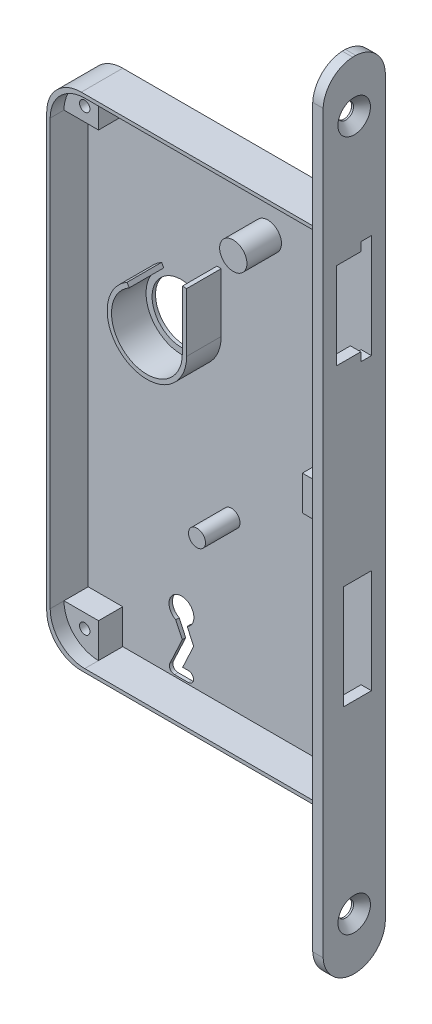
ISO-10303-21;
HEADER;
FILE_DESCRIPTION(('STEP AP214'),'2;1');
FILE_NAME('part.step','',(''),(''),'','','');
FILE_SCHEMA(('AUTOMOTIVE_DESIGN { 1 0 10303 214 1 1 1 1 }'));
ENDSEC;
DATA;
#1=APPLICATION_CONTEXT('core data for automotive mechanical design processes');
#2=APPLICATION_PROTOCOL_DEFINITION('international standard','automotive_design',2000,#1);
#3=PRODUCT_CONTEXT('',#1,'mechanical');
#4=PRODUCT('Part','Part','',(#3));
#5=PRODUCT_RELATED_PRODUCT_CATEGORY('part','',(#4));
#6=PRODUCT_DEFINITION_FORMATION('','',#4);
#7=PRODUCT_DEFINITION_CONTEXT('part definition',#1,'design');
#8=PRODUCT_DEFINITION('design','',#6,#7);
#9=PRODUCT_DEFINITION_SHAPE('','',#8);
#10=(LENGTH_UNIT() NAMED_UNIT(*) SI_UNIT(.MILLI.,.METRE.));
#11=(NAMED_UNIT(*) PLANE_ANGLE_UNIT() SI_UNIT($,.RADIAN.));
#12=(NAMED_UNIT(*) SI_UNIT($,.STERADIAN.) SOLID_ANGLE_UNIT());
#13=UNCERTAINTY_MEASURE_WITH_UNIT(LENGTH_MEASURE(1.E-05),#10,'distance_accuracy_value','');
#14=(GEOMETRIC_REPRESENTATION_CONTEXT(3) GLOBAL_UNCERTAINTY_ASSIGNED_CONTEXT((#13)) GLOBAL_UNIT_ASSIGNED_CONTEXT((#10,
#11,#12)) REPRESENTATION_CONTEXT('',''));
#15=CARTESIAN_POINT('',(0.,0.,0.));
#16=DIRECTION('',(0.,0.,1.));
#17=DIRECTION('',(1.,0.,0.));
#18=AXIS2_PLACEMENT_3D('',#15,#16,#17);
#19=CARTESIAN_POINT('',(-81.9999999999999,-61.5,9.));
#20=DIRECTION('',(0.,1.,0.));
#21=DIRECTION('',(0.,0.,1.));
#22=AXIS2_PLACEMENT_3D('',#19,#20,#21);
#23=PLANE('',#22);
#24=DIRECTION('',(0.,0.,-1.));
#25=VECTOR('',#24,1.);
#26=CARTESIAN_POINT('',(-81.9999999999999,-61.5,9.));
#27=LINE('',#26,#25);
#28=CARTESIAN_POINT('',(-81.9999999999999,-61.5,1.99999999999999));
#29=VERTEX_POINT('',#28);
#30=CARTESIAN_POINT('',(-81.9999999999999,-61.5,-5.));
#31=VERTEX_POINT('',#30);
#32=EDGE_CURVE('E429',#29,#31,#27,.T.);
#33=ORIENTED_EDGE('',*,*,#32,.F.);
#34=DIRECTION('',(-1.,0.,0.));
#35=VECTOR('',#34,1.);
#36=CARTESIAN_POINT('',(-81.9999999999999,-61.5,1.99999999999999));
#37=LINE('',#36,#35);
#38=CARTESIAN_POINT('',(-71.9999999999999,-61.5,1.99999999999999));
#39=VERTEX_POINT('',#38);
#40=EDGE_CURVE('E410',#39,#29,#37,.T.);
#41=ORIENTED_EDGE('',*,*,#40,.F.);
#42=DIRECTION('',(0.,0.,-1.));
#43=VECTOR('',#42,1.);
#44=CARTESIAN_POINT('',(-71.9999999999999,-61.5,9.));
#45=LINE('',#44,#43);
#46=CARTESIAN_POINT('',(-71.9999999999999,-61.5,-5.));
#47=VERTEX_POINT('',#46);
#48=EDGE_CURVE('E401',#39,#47,#45,.T.);
#49=ORIENTED_EDGE('',*,*,#48,.T.);
#50=DIRECTION('',(1.,0.,0.));
#51=VECTOR('',#50,1.);
#52=CARTESIAN_POINT('',(-81.9999999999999,-61.5,-5.));
#53=LINE('',#52,#51);
#54=EDGE_CURVE('E866',#31,#47,#53,.T.);
#55=ORIENTED_EDGE('',*,*,#54,.F.);
#56=EDGE_LOOP('',(#33,#41,#49,#55));
#57=FACE_BOUND('',#56,.T.);
#58=ADVANCED_FACE('F32',(#57),#23,.T.);
#59=CARTESIAN_POINT('',(-71.9999999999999,-61.5,9.));
#60=DIRECTION('',(1.,0.,0.));
#61=DIRECTION('',(0.,0.,-1.));
#62=AXIS2_PLACEMENT_3D('',#59,#60,#61);
#63=PLANE('',#62);
#64=ORIENTED_EDGE('',*,*,#48,.F.);
#65=DIRECTION('',(0.,1.,0.));
#66=VECTOR('',#65,1.);
#67=CARTESIAN_POINT('',(-71.9999999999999,-61.5,1.99999999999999));
#68=LINE('',#67,#66);
#69=CARTESIAN_POINT('',(-71.9999999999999,-71.5,1.99999999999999));
#70=VERTEX_POINT('',#69);
#71=EDGE_CURVE('E408',#70,#39,#68,.T.);
#72=ORIENTED_EDGE('',*,*,#71,.F.);
#73=DIRECTION('',(0.,0.,-1.));
#74=VECTOR('',#73,1.);
#75=CARTESIAN_POINT('',(-71.9999999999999,-71.5,9.));
#76=LINE('',#75,#74);
#77=CARTESIAN_POINT('',(-71.9999999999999,-71.5,-5.));
#78=VERTEX_POINT('',#77);
#79=EDGE_CURVE('E402',#70,#78,#76,.T.);
#80=ORIENTED_EDGE('',*,*,#79,.T.);
#81=DIRECTION('',(0.,-1.,0.));
#82=VECTOR('',#81,1.);
#83=CARTESIAN_POINT('',(-71.9999999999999,-61.5,-5.));
#84=LINE('',#83,#82);
#85=EDGE_CURVE('E869',#47,#78,#84,.T.);
#86=ORIENTED_EDGE('',*,*,#85,.F.);
#87=EDGE_LOOP('',(#64,#72,#80,#86));
#88=FACE_BOUND('',#87,.T.);
#89=ADVANCED_FACE('F415',(#88),#63,.T.);
#90=CARTESIAN_POINT('',(-72.,61.5,9.));
#91=DIRECTION('',(1.,0.,0.));
#92=DIRECTION('',(0.,0.,-1.));
#93=AXIS2_PLACEMENT_3D('',#90,#91,#92);
#94=PLANE('',#93);
#95=DIRECTION('',(0.,0.,-1.));
#96=VECTOR('',#95,1.);
#97=CARTESIAN_POINT('',(-72.,71.5,9.));
#98=LINE('',#97,#96);
#99=CARTESIAN_POINT('',(-72.,71.5,1.99999999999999));
#100=VERTEX_POINT('',#99);
#101=CARTESIAN_POINT('',(-72.,71.5,-5.));
#102=VERTEX_POINT('',#101);
#103=EDGE_CURVE('E892',#100,#102,#98,.T.);
#104=ORIENTED_EDGE('',*,*,#103,.F.);
#105=DIRECTION('',(0.,1.,0.));
#106=VECTOR('',#105,1.);
#107=CARTESIAN_POINT('',(-72.,61.5,1.99999999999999));
#108=LINE('',#107,#106);
#109=CARTESIAN_POINT('',(-72.,61.5,1.99999999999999));
#110=VERTEX_POINT('',#109);
#111=EDGE_CURVE('E486',#110,#100,#108,.T.);
#112=ORIENTED_EDGE('',*,*,#111,.F.);
#113=DIRECTION('',(0.,0.,-1.));
#114=VECTOR('',#113,1.);
#115=CARTESIAN_POINT('',(-72.,61.5,9.));
#116=LINE('',#115,#114);
#117=CARTESIAN_POINT('',(-72.,61.5,-5.));
#118=VERTEX_POINT('',#117);
#119=EDGE_CURVE('E436',#110,#118,#116,.T.);
#120=ORIENTED_EDGE('',*,*,#119,.T.);
#121=DIRECTION('',(0.,-1.,0.));
#122=VECTOR('',#121,1.);
#123=CARTESIAN_POINT('',(-72.,61.5,-5.));
#124=LINE('',#123,#122);
#125=EDGE_CURVE('E857',#102,#118,#124,.T.);
#126=ORIENTED_EDGE('',*,*,#125,.F.);
#127=EDGE_LOOP('',(#104,#112,#120,#126));
#128=FACE_BOUND('',#127,.T.);
#129=ADVANCED_FACE('F957',(#128),#94,.T.);
#130=CARTESIAN_POINT('',(-81.9999999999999,61.5,9.));
#131=DIRECTION('',(0.,-1.,0.));
#132=DIRECTION('',(0.,0.,-1.));
#133=AXIS2_PLACEMENT_3D('',#130,#131,#132);
#134=PLANE('',#133);
#135=ORIENTED_EDGE('',*,*,#119,.F.);
#136=DIRECTION('',(1.,0.,0.));
#137=VECTOR('',#136,1.);
#138=CARTESIAN_POINT('',(-81.9999999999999,61.5,1.99999999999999));
#139=LINE('',#138,#137);
#140=CARTESIAN_POINT('',(-81.9999999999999,61.5,1.99999999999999));
#141=VERTEX_POINT('',#140);
#142=EDGE_CURVE('E492',#141,#110,#139,.T.);
#143=ORIENTED_EDGE('',*,*,#142,.F.);
#144=DIRECTION('',(0.,0.,-1.));
#145=VECTOR('',#144,1.);
#146=CARTESIAN_POINT('',(-81.9999999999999,61.5,9.));
#147=LINE('',#146,#145);
#148=CARTESIAN_POINT('',(-81.9999999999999,61.5,-5.));
#149=VERTEX_POINT('',#148);
#150=EDGE_CURVE('E433',#141,#149,#147,.T.);
#151=ORIENTED_EDGE('',*,*,#150,.T.);
#152=DIRECTION('',(-1.,0.,0.));
#153=VECTOR('',#152,1.);
#154=CARTESIAN_POINT('',(-81.9999999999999,61.5,-5.));
#155=LINE('',#154,#153);
#156=EDGE_CURVE('E860',#118,#149,#155,.T.);
#157=ORIENTED_EDGE('',*,*,#156,.F.);
#158=EDGE_LOOP('',(#135,#143,#151,#157));
#159=FACE_BOUND('',#158,.T.);
#160=ADVANCED_FACE('F961',(#159),#134,.T.);
#161=CARTESIAN_POINT('',(-13.,-5.,9.));
#162=DIRECTION('',(0.,-1.,0.));
#163=DIRECTION('',(0.,0.,-1.));
#164=AXIS2_PLACEMENT_3D('',#161,#162,#163);
#165=PLANE('',#164);
#166=DIRECTION('',(0.,0.,-1.));
#167=VECTOR('',#166,1.);
#168=CARTESIAN_POINT('',(-2.99999999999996,-5.,9.));
#169=LINE('',#168,#167);
#170=CARTESIAN_POINT('',(-3.,-5.00000000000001,1.99999999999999));
#171=VERTEX_POINT('',#170);
#172=CARTESIAN_POINT('',(-2.99999999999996,-5.,-5.));
#173=VERTEX_POINT('',#172);
#174=EDGE_CURVE('E424',#171,#173,#169,.T.);
#175=ORIENTED_EDGE('',*,*,#174,.F.);
#176=DIRECTION('',(1.,0.,0.));
#177=VECTOR('',#176,1.);
#178=CARTESIAN_POINT('',(-12.9999999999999,-5.00000000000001,1.99999999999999));
#179=LINE('',#178,#177);
#180=CARTESIAN_POINT('',(-12.9999999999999,-5.00000000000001,1.99999999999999));
#181=VERTEX_POINT('',#180);
#182=EDGE_CURVE('E482',#181,#171,#179,.T.);
#183=ORIENTED_EDGE('',*,*,#182,.F.);
#184=DIRECTION('',(0.,0.,-1.));
#185=VECTOR('',#184,1.);
#186=CARTESIAN_POINT('',(-13.,-5.,9.));
#187=LINE('',#186,#185);
#188=CARTESIAN_POINT('',(-13.,-5.,-5.));
#189=VERTEX_POINT('',#188);
#190=EDGE_CURVE('E903',#181,#189,#187,.T.);
#191=ORIENTED_EDGE('',*,*,#190,.T.);
#192=DIRECTION('',(-1.,0.,0.));
#193=VECTOR('',#192,1.);
#194=CARTESIAN_POINT('',(-13.,-5.,-5.));
#195=LINE('',#194,#193);
#196=EDGE_CURVE('E876',#173,#189,#195,.T.);
#197=ORIENTED_EDGE('',*,*,#196,.F.);
#198=EDGE_LOOP('',(#175,#183,#191,#197));
#199=FACE_BOUND('',#198,.T.);
#200=ADVANCED_FACE('F918',(#199),#165,.T.);
#201=CARTESIAN_POINT('',(-13.,5.,9.));
#202=DIRECTION('',(-1.,0.,0.));
#203=DIRECTION('',(0.,-1.,0.));
#204=AXIS2_PLACEMENT_3D('',#201,#202,#203);
#205=PLANE('',#204);
#206=ORIENTED_EDGE('',*,*,#190,.F.);
#207=DIRECTION('',(0.,-1.,0.));
#208=VECTOR('',#207,1.);
#209=CARTESIAN_POINT('',(-12.9999999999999,5.,1.99999999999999));
#210=LINE('',#209,#208);
#211=CARTESIAN_POINT('',(-12.9999999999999,5.,1.99999999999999));
#212=VERTEX_POINT('',#211);
#213=EDGE_CURVE('E505',#212,#181,#210,.T.);
#214=ORIENTED_EDGE('',*,*,#213,.F.);
#215=DIRECTION('',(0.,0.,-1.));
#216=VECTOR('',#215,1.);
#217=CARTESIAN_POINT('',(-13.,5.,9.));
#218=LINE('',#217,#216);
#219=CARTESIAN_POINT('',(-13.,5.,-5.));
#220=VERTEX_POINT('',#219);
#221=EDGE_CURVE('E901',#212,#220,#218,.T.);
#222=ORIENTED_EDGE('',*,*,#221,.T.);
#223=DIRECTION('',(0.,1.,0.));
#224=VECTOR('',#223,1.);
#225=CARTESIAN_POINT('',(-13.,5.,-5.));
#226=LINE('',#225,#224);
#227=EDGE_CURVE('E879',#189,#220,#226,.T.);
#228=ORIENTED_EDGE('',*,*,#227,.F.);
#229=EDGE_LOOP('',(#206,#214,#222,#228));
#230=FACE_BOUND('',#229,.T.);
#231=ADVANCED_FACE('F923',(#230),#205,.T.);
#232=CARTESIAN_POINT('',(-2.99999999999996,5.,9.));
#233=DIRECTION('',(0.,1.,0.));
#234=DIRECTION('',(-1.,0.,0.));
#235=AXIS2_PLACEMENT_3D('',#232,#233,#234);
#236=PLANE('',#235);
#237=ORIENTED_EDGE('',*,*,#221,.F.);
#238=DIRECTION('',(-1.,0.,0.));
#239=VECTOR('',#238,1.);
#240=CARTESIAN_POINT('',(-12.9999999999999,5.,1.99999999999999));
#241=LINE('',#240,#239);
#242=CARTESIAN_POINT('',(-3.,5.,1.99999999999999));
#243=VERTEX_POINT('',#242);
#244=EDGE_CURVE('E489',#243,#212,#241,.T.);
#245=ORIENTED_EDGE('',*,*,#244,.F.);
#246=DIRECTION('',(0.,0.,-1.));
#247=VECTOR('',#246,1.);
#248=CARTESIAN_POINT('',(-2.99999999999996,5.,9.));
#249=LINE('',#248,#247);
#250=CARTESIAN_POINT('',(-2.99999999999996,5.,-5.));
#251=VERTEX_POINT('',#250);
#252=EDGE_CURVE('E899',#243,#251,#249,.T.);
#253=ORIENTED_EDGE('',*,*,#252,.T.);
#254=DIRECTION('',(1.,0.,0.));
#255=VECTOR('',#254,1.);
#256=CARTESIAN_POINT('',(-2.99999999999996,5.,-5.));
#257=LINE('',#256,#255);
#258=EDGE_CURVE('E882',#220,#251,#257,.T.);
#259=ORIENTED_EDGE('',*,*,#258,.F.);
#260=EDGE_LOOP('',(#237,#245,#253,#259));
#261=FACE_BOUND('',#260,.T.);
#262=ADVANCED_FACE('F928',(#261),#236,.T.);
#263=CARTESIAN_POINT('',(-72.,71.5,-5.));
#264=DIRECTION('',(0.,0.,-1.));
#265=DIRECTION('',(-1.,0.,0.));
#266=AXIS2_PLACEMENT_3D('',#263,#264,#265);
#267=PLANE('',#266);
#268=CARTESIAN_POINT('',(-55.,20.5,-5.));
#269=DIRECTION('',(0.,0.,1.));
#270=DIRECTION('',(-1.,0.,0.));
#271=AXIS2_PLACEMENT_3D('',#268,#269,#270);
#272=CIRCLE('',#271,11.5);
#273=CARTESIAN_POINT('',(-60.7499999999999,30.4592921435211,-5.));
#274=VERTEX_POINT('',#273);
#275=CARTESIAN_POINT('',(-43.4999999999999,20.4999999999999,-5.));
#276=VERTEX_POINT('',#275);
#277=EDGE_CURVE('E608',#274,#276,#272,.T.);
#278=ORIENTED_EDGE('',*,*,#277,.F.);
#279=DIRECTION('',(-0.499999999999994,0.866025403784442,0.));
#280=VECTOR('',#279,1.);
#281=CARTESIAN_POINT('',(-60.1249999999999,29.3767603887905,-5.));
#282=LINE('',#281,#280);
#283=CARTESIAN_POINT('',(-60.1249999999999,29.3767603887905,-5.));
#284=VERTEX_POINT('',#283);
#285=EDGE_CURVE('E615',#284,#274,#282,.T.);
#286=ORIENTED_EDGE('',*,*,#285,.F.);
#287=CARTESIAN_POINT('',(-55.,20.5,-5.));
#288=DIRECTION('',(0.,0.,-1.));
#289=DIRECTION('',(-1.,0.,0.));
#290=AXIS2_PLACEMENT_3D('',#287,#288,#289);
#291=CIRCLE('',#290,10.25);
#292=CARTESIAN_POINT('',(-44.75,20.4999999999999,-5.));
#293=VERTEX_POINT('',#292);
#294=EDGE_CURVE('E637',#293,#284,#291,.T.);
#295=ORIENTED_EDGE('',*,*,#294,.F.);
#296=DIRECTION('',(0.,-1.,0.));
#297=VECTOR('',#296,1.);
#298=CARTESIAN_POINT('',(-44.7499999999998,37.4999999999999,-5.));
#299=LINE('',#298,#297);
#300=CARTESIAN_POINT('',(-44.7499999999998,37.4999999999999,-5.));
#301=VERTEX_POINT('',#300);
#302=EDGE_CURVE('E634',#301,#293,#299,.T.);
#303=ORIENTED_EDGE('',*,*,#302,.F.);
#304=DIRECTION('',(-1.,0.,0.));
#305=VECTOR('',#304,1.);
#306=CARTESIAN_POINT('',(-43.4999999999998,37.4999999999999,-5.));
#307=LINE('',#306,#305);
#308=CARTESIAN_POINT('',(-43.4999999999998,37.4999999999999,-5.));
#309=VERTEX_POINT('',#308);
#310=EDGE_CURVE('E631',#309,#301,#307,.T.);
#311=ORIENTED_EDGE('',*,*,#310,.F.);
#312=DIRECTION('',(0.,1.,0.));
#313=VECTOR('',#312,1.);
#314=CARTESIAN_POINT('',(-43.4999999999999,20.4999999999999,-5.));
#315=LINE('',#314,#313);
#316=EDGE_CURVE('E628',#276,#309,#315,.T.);
#317=ORIENTED_EDGE('',*,*,#316,.F.);
#318=EDGE_LOOP('',(#278,#286,#295,#303,#311,#317));
#319=FACE_BOUND('',#318,.T.);
#320=CARTESIAN_POINT('',(-30.,52.5,-5.));
#321=DIRECTION('',(0.,0.,-1.));
#322=DIRECTION('',(-1.,0.,0.));
#323=AXIS2_PLACEMENT_3D('',#320,#321,#322);
#324=CIRCLE('',#323,3.95);
#325=CARTESIAN_POINT('',(-33.95,52.5,-5.));
#326=VERTEX_POINT('',#325);
#327=EDGE_CURVE('E41',#326,#326,#324,.F.);
#328=ORIENTED_EDGE('',*,*,#327,.F.);
#329=EDGE_LOOP('',(#328));
#330=FACE_BOUND('',#329,.T.);
#331=DIRECTION('',(0.,1.,0.));
#332=VECTOR('',#331,1.);
#333=CARTESIAN_POINT('',(-2.99999999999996,-5.,-5.));
#334=LINE('',#333,#332);
#335=CARTESIAN_POINT('',(-2.99999999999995,-71.5,-5.));
#336=VERTEX_POINT('',#335);
#337=CARTESIAN_POINT('',(-2.99999999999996,-46.55,-5.00000000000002));
#338=VERTEX_POINT('',#337);
#339=EDGE_CURVE('E873',#336,#338,#334,.T.);
#340=ORIENTED_EDGE('',*,*,#339,.T.);
#341=DIRECTION('',(1.,0.,0.));
#342=VECTOR('',#341,1.);
#343=CARTESIAN_POINT('',(-10.,-46.55,-5.00000000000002));
#344=LINE('',#343,#342);
#345=CARTESIAN_POINT('',(0.,-46.55,-5.00000000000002));
#346=VERTEX_POINT('',#345);
#347=EDGE_CURVE('E704',#338,#346,#344,.T.);
#348=ORIENTED_EDGE('',*,*,#347,.T.);
#349=DIRECTION('',(0.,1.,0.));
#350=VECTOR('',#349,1.);
#351=CARTESIAN_POINT('',(0.,-46.55,-5.00000000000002));
#352=LINE('',#351,#350);
#353=CARTESIAN_POINT('',(0.,-16.45,-5.00000000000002));
#354=VERTEX_POINT('',#353);
#355=EDGE_CURVE('E697',#346,#354,#352,.T.);
#356=ORIENTED_EDGE('',*,*,#355,.T.);
#357=DIRECTION('',(1.,0.,0.));
#358=VECTOR('',#357,1.);
#359=CARTESIAN_POINT('',(-10.,-16.45,-5.00000000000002));
#360=LINE('',#359,#358);
#361=CARTESIAN_POINT('',(-2.99999999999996,-16.45,-5.00000000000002));
#362=VERTEX_POINT('',#361);
#363=EDGE_CURVE('E701',#362,#354,#360,.T.);
#364=ORIENTED_EDGE('',*,*,#363,.F.);
#365=EDGE_CURVE('E872',#362,#173,#334,.T.);
#366=ORIENTED_EDGE('',*,*,#365,.T.);
#367=ORIENTED_EDGE('',*,*,#196,.T.);
#368=ORIENTED_EDGE('',*,*,#227,.T.);
#369=ORIENTED_EDGE('',*,*,#258,.T.);
#370=DIRECTION('',(0.,1.,0.));
#371=VECTOR('',#370,1.);
#372=CARTESIAN_POINT('',(-2.99999999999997,71.5,-5.));
#373=LINE('',#372,#371);
#374=CARTESIAN_POINT('',(-2.99999999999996,37.45,-5.00000000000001));
#375=VERTEX_POINT('',#374);
#376=EDGE_CURVE('E886',#251,#375,#373,.T.);
#377=ORIENTED_EDGE('',*,*,#376,.T.);
#378=DIRECTION('',(1.,0.,0.));
#379=VECTOR('',#378,1.);
#380=CARTESIAN_POINT('',(-10.,37.45,-5.00000000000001));
#381=LINE('',#380,#379);
#382=CARTESIAN_POINT('',(0.,37.45,-5.00000000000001));
#383=VERTEX_POINT('',#382);
#384=EDGE_CURVE('E745',#375,#383,#381,.T.);
#385=ORIENTED_EDGE('',*,*,#384,.T.);
#386=DIRECTION('',(0.,1.,0.));
#387=VECTOR('',#386,1.);
#388=CARTESIAN_POINT('',(0.,67.55,-5.00000000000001));
#389=LINE('',#388,#387);
#390=CARTESIAN_POINT('',(0.,67.55,-5.00000000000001));
#391=VERTEX_POINT('',#390);
#392=EDGE_CURVE('E738',#383,#391,#389,.T.);
#393=ORIENTED_EDGE('',*,*,#392,.T.);
#394=DIRECTION('',(1.,0.,0.));
#395=VECTOR('',#394,1.);
#396=CARTESIAN_POINT('',(-10.,67.55,-5.00000000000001));
#397=LINE('',#396,#395);
#398=CARTESIAN_POINT('',(-2.99999999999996,67.55,-5.00000000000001));
#399=VERTEX_POINT('',#398);
#400=EDGE_CURVE('E742',#399,#391,#397,.T.);
#401=ORIENTED_EDGE('',*,*,#400,.F.);
#402=CARTESIAN_POINT('',(-2.99999999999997,71.5,-5.));
#403=VERTEX_POINT('',#402);
#404=EDGE_CURVE('E885',#399,#403,#373,.T.);
#405=ORIENTED_EDGE('',*,*,#404,.T.);
#406=DIRECTION('',(-1.,0.,0.));
#407=VECTOR('',#406,1.);
#408=CARTESIAN_POINT('',(-72.,71.5,-5.));
#409=LINE('',#408,#407);
#410=EDGE_CURVE('E889',#403,#102,#409,.T.);
#411=ORIENTED_EDGE('',*,*,#410,.T.);
#412=ORIENTED_EDGE('',*,*,#125,.T.);
#413=ORIENTED_EDGE('',*,*,#156,.T.);
#414=DIRECTION('',(0.,-1.,0.));
#415=VECTOR('',#414,1.);
#416=CARTESIAN_POINT('',(-81.9999999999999,61.5,-5.));
#417=LINE('',#416,#415);
#418=EDGE_CURVE('E863',#149,#31,#417,.T.);
#419=ORIENTED_EDGE('',*,*,#418,.T.);
#420=ORIENTED_EDGE('',*,*,#54,.T.);
#421=ORIENTED_EDGE('',*,*,#85,.T.);
#422=DIRECTION('',(1.,0.,0.));
#423=VECTOR('',#422,1.);
#424=CARTESIAN_POINT('',(-2.99999999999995,-71.5,-5.));
#425=LINE('',#424,#423);
#426=EDGE_CURVE('E421',#78,#336,#425,.T.);
#427=ORIENTED_EDGE('',*,*,#426,.T.);
#428=EDGE_LOOP('',(#340,#348,#356,#364,#366,#367,#368,#369,#377,#385,#393,#401,#405,#411,#412,
#413,#419,#420,#421,#427));
#429=FACE_BOUND('',#428,.T.);
#430=CARTESIAN_POINT('',(-40.5,-23.5,-5.));
#431=DIRECTION('',(0.,0.,-1.));
#432=DIRECTION('',(-1.,0.,0.));
#433=AXIS2_PLACEMENT_3D('',#430,#431,#432);
#434=CIRCLE('',#433,2.45000000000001);
#435=CARTESIAN_POINT('',(-42.95,-23.5,-5.));
#436=VERTEX_POINT('',#435);
#437=EDGE_CURVE('E11',#436,#436,#434,.F.);
#438=ORIENTED_EDGE('',*,*,#437,.F.);
#439=EDGE_LOOP('',(#438));
#440=FACE_BOUND('',#439,.T.);
#441=CARTESIAN_POINT('',(-55.,20.5,-5.));
#442=DIRECTION('',(0.,0.,1.));
#443=DIRECTION('',(1.,0.,0.));
#444=AXIS2_PLACEMENT_3D('',#441,#442,#443);
#445=CIRCLE('',#444,8.5);
#446=CARTESIAN_POINT('',(-46.5,20.5,-5.));
#447=VERTEX_POINT('',#446);
#448=EDGE_CURVE('E605',#447,#447,#445,.T.);
#449=ORIENTED_EDGE('',*,*,#448,.F.);
#450=EDGE_LOOP('',(#449));
#451=FACE_BOUND('',#450,.T.);
#452=CARTESIAN_POINT('',(-55.,-53.9,-5.));
#453=DIRECTION('',(0.,0.,-1.));
#454=DIRECTION('',(-1.,0.,0.));
#455=AXIS2_PLACEMENT_3D('',#452,#453,#454);
#456=CIRCLE('',#455,3.6);
#457=CARTESIAN_POINT('',(-56.6550668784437,-57.0969913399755,-5.));
#458=VERTEX_POINT('',#457);
#459=CARTESIAN_POINT('',(-53.3449331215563,-57.0969913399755,-5.));
#460=VERTEX_POINT('',#459);
#461=EDGE_CURVE('E556',#458,#460,#456,.T.);
#462=ORIENTED_EDGE('',*,*,#461,.T.);
#463=DIRECTION('',(0.4226182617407,-0.906307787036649,0.));
#464=VECTOR('',#463,1.);
#465=CARTESIAN_POINT('',(-53.3449331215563,-57.0969913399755,-5.));
#466=LINE('',#465,#464);
#467=CARTESIAN_POINT('',(-51.4531241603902,-61.1539887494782,-5.));
#468=VERTEX_POINT('',#467);
#469=EDGE_CURVE('E601',#460,#468,#466,.T.);
#470=ORIENTED_EDGE('',*,*,#469,.T.);
#471=DIRECTION('',(-0.422618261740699,-0.90630778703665,0.));
#472=VECTOR('',#471,1.);
#473=CARTESIAN_POINT('',(-51.4531241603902,-61.1539887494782,-5.));
#474=LINE('',#473,#472);
#475=CARTESIAN_POINT('',(-54.6454716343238,-68.,-5.));
#476=VERTEX_POINT('',#475);
#477=EDGE_CURVE('E535',#468,#476,#474,.T.);
#478=ORIENTED_EDGE('',*,*,#477,.T.);
#479=DIRECTION('',(1.,0.,0.));
#480=VECTOR('',#479,1.);
#481=CARTESIAN_POINT('',(-54.6454716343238,-68.,-5.));
#482=LINE('',#481,#480);
#483=CARTESIAN_POINT('',(-53.,-68.,-5.));
#484=VERTEX_POINT('',#483);
#485=EDGE_CURVE('E538',#476,#484,#482,.T.);
#486=ORIENTED_EDGE('',*,*,#485,.T.);
#487=CARTESIAN_POINT('',(-53.,-69.5,-5.));
#488=DIRECTION('',(0.,0.,-1.));
#489=DIRECTION('',(-1.,0.,0.));
#490=AXIS2_PLACEMENT_3D('',#487,#488,#489);
#491=CIRCLE('',#490,1.5);
#492=CARTESIAN_POINT('',(-53.,-71.,-5.));
#493=VERTEX_POINT('',#492);
#494=EDGE_CURVE('E541',#484,#493,#491,.T.);
#495=ORIENTED_EDGE('',*,*,#494,.T.);
#496=DIRECTION('',(-1.,0.,0.));
#497=VECTOR('',#496,1.);
#498=CARTESIAN_POINT('',(-57.,-71.,-5.));
#499=LINE('',#498,#497);
#500=CARTESIAN_POINT('',(-57.,-71.,-5.));
#501=VERTEX_POINT('',#500);
#502=EDGE_CURVE('E544',#493,#501,#499,.T.);
#503=ORIENTED_EDGE('',*,*,#502,.T.);
#504=CARTESIAN_POINT('',(-57.,-69.5,-5.));
#505=DIRECTION('',(0.,0.,-1.));
#506=DIRECTION('',(-1.,0.,0.));
#507=AXIS2_PLACEMENT_3D('',#504,#505,#506);
#508=CIRCLE('',#507,1.5);
#509=CARTESIAN_POINT('',(-58.359461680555,-68.8660726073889,-5.));
#510=VERTEX_POINT('',#509);
#511=EDGE_CURVE('E547',#501,#510,#508,.T.);
#512=ORIENTED_EDGE('',*,*,#511,.T.);
#513=DIRECTION('',(0.422618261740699,0.90630778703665,0.));
#514=VECTOR('',#513,1.);
#515=CARTESIAN_POINT('',(-54.7632579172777,-61.1539887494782,-5.));
#516=LINE('',#515,#514);
#517=CARTESIAN_POINT('',(-54.7632579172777,-61.1539887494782,-5.));
#518=VERTEX_POINT('',#517);
#519=EDGE_CURVE('E550',#510,#518,#516,.T.);
#520=ORIENTED_EDGE('',*,*,#519,.T.);
#521=DIRECTION('',(-0.422618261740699,0.90630778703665,0.));
#522=VECTOR('',#521,1.);
#523=CARTESIAN_POINT('',(-56.6550668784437,-57.0969913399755,-5.));
#524=LINE('',#523,#522);
#525=EDGE_CURVE('E553',#518,#458,#524,.T.);
#526=ORIENTED_EDGE('',*,*,#525,.T.);
#527=EDGE_LOOP('',(#462,#470,#478,#486,#495,#503,#512,#520,#526));
#528=FACE_BOUND('',#527,.T.);
#529=ADVANCED_FACE('F916',(#319,#330,#429,#440,#451,#528),#267,.F.);
#530=CARTESIAN_POINT('',(-3.,72.5,-6.));
#531=DIRECTION('',(0.,0.,-1.));
#532=DIRECTION('',(0.,1.,0.));
#533=AXIS2_PLACEMENT_3D('',#530,#531,#532);
#534=PLANE('',#533);
#535=CARTESIAN_POINT('',(-73.,62.5,-6.));
#536=DIRECTION('',(0.,0.,-1.));
#537=DIRECTION('',(0.,1.,0.));
#538=AXIS2_PLACEMENT_3D('',#535,#536,#537);
#539=CIRCLE('',#538,9.99999999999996);
#540=CARTESIAN_POINT('',(-83.,62.5,-6.));
#541=VERTEX_POINT('',#540);
#542=CARTESIAN_POINT('',(-73.,72.5,-6.));
#543=VERTEX_POINT('',#542);
#544=EDGE_CURVE('E835',#541,#543,#539,.T.);
#545=ORIENTED_EDGE('',*,*,#544,.T.);
#546=DIRECTION('',(-1.,0.,0.));
#547=VECTOR('',#546,1.);
#548=CARTESIAN_POINT('',(-3.,72.5,-6.));
#549=LINE('',#548,#547);
#550=CARTESIAN_POINT('',(-3.,72.5,-6.));
#551=VERTEX_POINT('',#550);
#552=EDGE_CURVE('E830',#551,#543,#549,.T.);
#553=ORIENTED_EDGE('',*,*,#552,.F.);
#554=DIRECTION('',(0.,-1.,0.));
#555=VECTOR('',#554,1.);
#556=CARTESIAN_POINT('',(-3.,72.5,-6.));
#557=LINE('',#556,#555);
#558=CARTESIAN_POINT('',(-3.,-72.5,-6.00000000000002));
#559=VERTEX_POINT('',#558);
#560=EDGE_CURVE('E824',#551,#559,#557,.T.);
#561=ORIENTED_EDGE('',*,*,#560,.T.);
#562=DIRECTION('',(-1.,0.,0.));
#563=VECTOR('',#562,1.);
#564=CARTESIAN_POINT('',(-3.,-72.5,-6.00000000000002));
#565=LINE('',#564,#563);
#566=CARTESIAN_POINT('',(-73.,-72.5,-6.00000000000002));
#567=VERTEX_POINT('',#566);
#568=EDGE_CURVE('E826',#559,#567,#565,.T.);
#569=ORIENTED_EDGE('',*,*,#568,.T.);
#570=CARTESIAN_POINT('',(-73.,-62.5,-6.00000000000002));
#571=DIRECTION('',(0.,0.,-1.));
#572=DIRECTION('',(0.,1.,0.));
#573=AXIS2_PLACEMENT_3D('',#570,#571,#572);
#574=CIRCLE('',#573,9.99999999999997);
#575=CARTESIAN_POINT('',(-83.,-62.5,-6.00000000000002));
#576=VERTEX_POINT('',#575);
#577=EDGE_CURVE('E833',#567,#576,#574,.T.);
#578=ORIENTED_EDGE('',*,*,#577,.T.);
#579=DIRECTION('',(0.,-1.,0.));
#580=VECTOR('',#579,1.);
#581=CARTESIAN_POINT('',(-83.,72.5,-6.));
#582=LINE('',#581,#580);
#583=EDGE_CURVE('E823',#541,#576,#582,.T.);
#584=ORIENTED_EDGE('',*,*,#583,.F.);
#585=EDGE_LOOP('',(#545,#553,#561,#569,#578,#584));
#586=FACE_BOUND('',#585,.T.);
#587=CARTESIAN_POINT('',(-55.,20.5,-6.00000000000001));
#588=DIRECTION('',(0.,0.,-1.));
#589=DIRECTION('',(0.,1.,0.));
#590=AXIS2_PLACEMENT_3D('',#587,#588,#589);
#591=CIRCLE('',#590,8.5);
#592=CARTESIAN_POINT('',(-55.,29.,-6.));
#593=VERTEX_POINT('',#592);
#594=EDGE_CURVE('E604',#593,#593,#591,.F.);
#595=ORIENTED_EDGE('',*,*,#594,.T.);
#596=EDGE_LOOP('',(#595));
#597=FACE_BOUND('',#596,.T.);
#598=DIRECTION('',(-0.4226182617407,0.906307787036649,0.));
#599=VECTOR('',#598,1.);
#600=CARTESIAN_POINT('',(-53.3449331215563,-57.0969913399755,-6.00000000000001));
#601=LINE('',#600,#599);
#602=CARTESIAN_POINT('',(-51.4531241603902,-61.1539887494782,-6.00000000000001));
#603=VERTEX_POINT('',#602);
#604=CARTESIAN_POINT('',(-53.3449331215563,-57.0969913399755,-6.00000000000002));
#605=VERTEX_POINT('',#604);
#606=EDGE_CURVE('E581',#603,#605,#601,.T.);
#607=ORIENTED_EDGE('',*,*,#606,.T.);
#608=CARTESIAN_POINT('',(-55.,-53.9,-6.00000000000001));
#609=DIRECTION('',(0.,0.,1.));
#610=DIRECTION('',(-1.,0.,0.));
#611=AXIS2_PLACEMENT_3D('',#608,#609,#610);
#612=CIRCLE('',#611,3.6);
#613=CARTESIAN_POINT('',(-56.6550668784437,-57.0969913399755,-6.00000000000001));
#614=VERTEX_POINT('',#613);
#615=EDGE_CURVE('E57',#605,#614,#612,.T.);
#616=ORIENTED_EDGE('',*,*,#615,.T.);
#617=DIRECTION('',(0.422618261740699,-0.90630778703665,0.));
#618=VECTOR('',#617,1.);
#619=CARTESIAN_POINT('',(-56.6550668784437,-57.0969913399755,-6.00000000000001));
#620=LINE('',#619,#618);
#621=CARTESIAN_POINT('',(-54.7632579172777,-61.1539887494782,-6.00000000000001));
#622=VERTEX_POINT('',#621);
#623=EDGE_CURVE('E560',#614,#622,#620,.T.);
#624=ORIENTED_EDGE('',*,*,#623,.T.);
#625=DIRECTION('',(-0.422618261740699,-0.90630778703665,0.));
#626=VECTOR('',#625,1.);
#627=CARTESIAN_POINT('',(-54.7632579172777,-61.1539887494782,-6.00000000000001));
#628=LINE('',#627,#626);
#629=CARTESIAN_POINT('',(-58.359461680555,-68.8660726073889,-6.00000000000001));
#630=VERTEX_POINT('',#629);
#631=EDGE_CURVE('E563',#622,#630,#628,.T.);
#632=ORIENTED_EDGE('',*,*,#631,.T.);
#633=CARTESIAN_POINT('',(-57.,-69.5,-6.00000000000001));
#634=DIRECTION('',(0.,0.,1.));
#635=DIRECTION('',(1.,0.,0.));
#636=AXIS2_PLACEMENT_3D('',#633,#634,#635);
#637=CIRCLE('',#636,1.5);
#638=CARTESIAN_POINT('',(-57.,-71.,-6.00000000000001));
#639=VERTEX_POINT('',#638);
#640=EDGE_CURVE('E566',#630,#639,#637,.T.);
#641=ORIENTED_EDGE('',*,*,#640,.T.);
#642=DIRECTION('',(1.,0.,0.));
#643=VECTOR('',#642,1.);
#644=CARTESIAN_POINT('',(-57.,-71.,-6.00000000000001));
#645=LINE('',#644,#643);
#646=CARTESIAN_POINT('',(-53.,-71.,-6.00000000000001));
#647=VERTEX_POINT('',#646);
#648=EDGE_CURVE('E569',#639,#647,#645,.T.);
#649=ORIENTED_EDGE('',*,*,#648,.T.);
#650=CARTESIAN_POINT('',(-53.,-69.5,-6.00000000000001));
#651=DIRECTION('',(0.,0.,1.));
#652=DIRECTION('',(-1.,0.,0.));
#653=AXIS2_PLACEMENT_3D('',#650,#651,#652);
#654=CIRCLE('',#653,1.5);
#655=CARTESIAN_POINT('',(-53.,-68.,-6.00000000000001));
#656=VERTEX_POINT('',#655);
#657=EDGE_CURVE('E572',#647,#656,#654,.T.);
#658=ORIENTED_EDGE('',*,*,#657,.T.);
#659=DIRECTION('',(-1.,0.,0.));
#660=VECTOR('',#659,1.);
#661=CARTESIAN_POINT('',(-54.6454716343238,-68.,-6.00000000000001));
#662=LINE('',#661,#660);
#663=CARTESIAN_POINT('',(-54.6454716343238,-68.,-6.00000000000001));
#664=VERTEX_POINT('',#663);
#665=EDGE_CURVE('E575',#656,#664,#662,.T.);
#666=ORIENTED_EDGE('',*,*,#665,.T.);
#667=DIRECTION('',(0.422618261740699,0.90630778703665,0.));
#668=VECTOR('',#667,1.);
#669=CARTESIAN_POINT('',(-51.4531241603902,-61.1539887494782,-6.00000000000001));
#670=LINE('',#669,#668);
#671=EDGE_CURVE('E578',#664,#603,#670,.T.);
#672=ORIENTED_EDGE('',*,*,#671,.T.);
#673=EDGE_LOOP('',(#607,#616,#624,#632,#641,#649,#658,#666,#672));
#674=FACE_BOUND('',#673,.T.);
#675=ADVANCED_FACE('F1039',(#586,#597,#674),#534,.T.);
#676=CARTESIAN_POINT('',(-2.99999999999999,-115.,9.));
#677=DIRECTION('',(1.,0.,0.));
#678=DIRECTION('',(0.,1.,0.));
#679=AXIS2_PLACEMENT_3D('',#676,#677,#678);
#680=PLANE('',#679);
#681=DIRECTION('',(0.,1.,0.));
#682=VECTOR('',#681,1.);
#683=CARTESIAN_POINT('',(-3.,5.,1.99999999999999));
#684=LINE('',#683,#682);
#685=EDGE_CURVE('E485',#171,#243,#684,.T.);
#686=ORIENTED_EDGE('',*,*,#685,.F.);
#687=ORIENTED_EDGE('',*,*,#174,.T.);
#688=ORIENTED_EDGE('',*,*,#365,.F.);
#689=DIRECTION('',(0.,0.,1.));
#690=VECTOR('',#689,1.);
#691=CARTESIAN_POINT('',(-2.99999999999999,-16.45,9.));
#692=LINE('',#691,#690);
#693=CARTESIAN_POINT('',(-2.99999999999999,-16.45,3.09999999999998));
#694=VERTEX_POINT('',#693);
#695=EDGE_CURVE('E712',#362,#694,#692,.T.);
#696=ORIENTED_EDGE('',*,*,#695,.T.);
#697=DIRECTION('',(0.,-1.,0.));
#698=VECTOR('',#697,1.);
#699=CARTESIAN_POINT('',(-2.99999999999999,-115.,3.09999999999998));
#700=LINE('',#699,#698);
#701=CARTESIAN_POINT('',(-2.99999999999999,-46.55,3.09999999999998));
#702=VERTEX_POINT('',#701);
#703=EDGE_CURVE('E715',#694,#702,#700,.T.);
#704=ORIENTED_EDGE('',*,*,#703,.T.);
#705=DIRECTION('',(0.,0.,-1.));
#706=VECTOR('',#705,1.);
#707=CARTESIAN_POINT('',(-2.99999999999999,-46.55,9.));
#708=LINE('',#707,#706);
#709=EDGE_CURVE('E703',#702,#338,#708,.T.);
#710=ORIENTED_EDGE('',*,*,#709,.T.);
#711=ORIENTED_EDGE('',*,*,#339,.F.);
#712=DIRECTION('',(0.,0.,-1.));
#713=VECTOR('',#712,1.);
#714=CARTESIAN_POINT('',(-2.99999999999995,-71.5,9.));
#715=LINE('',#714,#713);
#716=CARTESIAN_POINT('',(-3.,-71.5,5.99999999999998));
#717=VERTEX_POINT('',#716);
#718=EDGE_CURVE('E423',#717,#336,#715,.T.);
#719=ORIENTED_EDGE('',*,*,#718,.F.);
#720=DIRECTION('',(0.,1.,0.));
#721=VECTOR('',#720,1.);
#722=CARTESIAN_POINT('',(-3.,72.5,6.));
#723=LINE('',#722,#721);
#724=CARTESIAN_POINT('',(-3.,-72.5,5.99999999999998));
#725=VERTEX_POINT('',#724);
#726=EDGE_CURVE('E838',#725,#717,#723,.T.);
#727=ORIENTED_EDGE('',*,*,#726,.F.);
#728=DIRECTION('',(0.,0.,-1.));
#729=VECTOR('',#728,1.);
#730=CARTESIAN_POINT('',(-2.99999999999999,-72.5,9.));
#731=LINE('',#730,#729);
#732=EDGE_CURVE('E454',#725,#559,#731,.T.);
#733=ORIENTED_EDGE('',*,*,#732,.T.);
#734=ORIENTED_EDGE('',*,*,#560,.F.);
#735=DIRECTION('',(0.,0.,-1.));
#736=VECTOR('',#735,1.);
#737=CARTESIAN_POINT('',(-2.99999999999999,72.5,9.));
#738=LINE('',#737,#736);
#739=CARTESIAN_POINT('',(-3.,72.5,6.));
#740=VERTEX_POINT('',#739);
#741=EDGE_CURVE('E469',#740,#551,#738,.T.);
#742=ORIENTED_EDGE('',*,*,#741,.F.);
#743=CARTESIAN_POINT('',(-2.99999999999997,71.5,5.99999999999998));
#744=VERTEX_POINT('',#743);
#745=EDGE_CURVE('E841',#744,#740,#723,.T.);
#746=ORIENTED_EDGE('',*,*,#745,.F.);
#747=DIRECTION('',(0.,0.,-1.));
#748=VECTOR('',#747,1.);
#749=CARTESIAN_POINT('',(-2.99999999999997,71.5,9.));
#750=LINE('',#749,#748);
#751=EDGE_CURVE('E896',#744,#403,#750,.T.);
#752=ORIENTED_EDGE('',*,*,#751,.T.);
#753=ORIENTED_EDGE('',*,*,#404,.F.);
#754=DIRECTION('',(0.,0.,1.));
#755=VECTOR('',#754,1.);
#756=CARTESIAN_POINT('',(-2.99999999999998,67.55,9.));
#757=LINE('',#756,#755);
#758=CARTESIAN_POINT('',(-2.99999999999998,67.55,-1.90000000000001));
#759=VERTEX_POINT('',#758);
#760=EDGE_CURVE('E761',#399,#759,#757,.T.);
#761=ORIENTED_EDGE('',*,*,#760,.T.);
#762=DIRECTION('',(0.,-1.,0.));
#763=VECTOR('',#762,1.);
#764=CARTESIAN_POINT('',(-2.99999999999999,-115.,-1.89999999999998));
#765=LINE('',#764,#763);
#766=CARTESIAN_POINT('',(-2.99999999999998,65.05,-1.90000000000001));
#767=VERTEX_POINT('',#766);
#768=EDGE_CURVE('E764',#759,#767,#765,.T.);
#769=ORIENTED_EDGE('',*,*,#768,.T.);
#770=DIRECTION('',(0.,0.,1.));
#771=VECTOR('',#770,1.);
#772=CARTESIAN_POINT('',(-2.99999999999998,65.05,9.));
#773=LINE('',#772,#771);
#774=CARTESIAN_POINT('',(-2.99999999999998,65.05,5.09999999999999));
#775=VERTEX_POINT('',#774);
#776=EDGE_CURVE('E767',#767,#775,#773,.T.);
#777=ORIENTED_EDGE('',*,*,#776,.T.);
#778=DIRECTION('',(0.,-1.,0.));
#779=VECTOR('',#778,1.);
#780=CARTESIAN_POINT('',(-2.99999999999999,-115.,5.09999999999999));
#781=LINE('',#780,#779);
#782=CARTESIAN_POINT('',(-2.99999999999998,39.95,5.09999999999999));
#783=VERTEX_POINT('',#782);
#784=EDGE_CURVE('E770',#775,#783,#781,.T.);
#785=ORIENTED_EDGE('',*,*,#784,.T.);
#786=DIRECTION('',(0.,0.,-1.));
#787=VECTOR('',#786,1.);
#788=CARTESIAN_POINT('',(-2.99999999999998,39.95,9.));
#789=LINE('',#788,#787);
#790=CARTESIAN_POINT('',(-2.99999999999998,39.95,-1.90000000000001));
#791=VERTEX_POINT('',#790);
#792=EDGE_CURVE('E773',#783,#791,#789,.T.);
#793=ORIENTED_EDGE('',*,*,#792,.T.);
#794=DIRECTION('',(0.,-1.,0.));
#795=VECTOR('',#794,1.);
#796=CARTESIAN_POINT('',(-2.99999999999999,-115.,-1.90000000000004));
#797=LINE('',#796,#795);
#798=CARTESIAN_POINT('',(-2.99999999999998,37.45,-1.90000000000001));
#799=VERTEX_POINT('',#798);
#800=EDGE_CURVE('E776',#791,#799,#797,.T.);
#801=ORIENTED_EDGE('',*,*,#800,.T.);
#802=DIRECTION('',(0.,0.,-1.));
#803=VECTOR('',#802,1.);
#804=CARTESIAN_POINT('',(-2.99999999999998,37.45,9.));
#805=LINE('',#804,#803);
#806=EDGE_CURVE('E744',#799,#375,#805,.T.);
#807=ORIENTED_EDGE('',*,*,#806,.T.);
#808=ORIENTED_EDGE('',*,*,#376,.F.);
#809=ORIENTED_EDGE('',*,*,#252,.F.);
#810=EDGE_LOOP('',(#686,#687,#688,#696,#704,#710,#711,#719,#727,#733,#734,#742,#746,#752,#753,
#761,#769,#777,#785,#793,#801,#807,#808,#809));
#811=FACE_BOUND('',#810,.T.);
#812=CARTESIAN_POINT('',(-2.99999999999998,100.,0.));
#813=DIRECTION('',(1.,0.,0.));
#814=DIRECTION('',(0.,0.,-1.));
#815=AXIS2_PLACEMENT_3D('',#812,#813,#814);
#816=CIRCLE('',#815,2.275);
#817=CARTESIAN_POINT('',(-2.99999999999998,100.,-2.275));
#818=VERTEX_POINT('',#817);
#819=EDGE_CURVE('E674',#818,#818,#816,.T.);
#820=ORIENTED_EDGE('',*,*,#819,.T.);
#821=EDGE_LOOP('',(#820));
#822=FACE_BOUND('',#821,.T.);
#823=CARTESIAN_POINT('',(-2.99999999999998,-100.,0.));
#824=DIRECTION('',(1.,0.,0.));
#825=DIRECTION('',(0.,0.,-1.));
#826=AXIS2_PLACEMENT_3D('',#823,#824,#825);
#827=CIRCLE('',#826,2.275);
#828=CARTESIAN_POINT('',(-2.99999999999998,-100.,-2.275));
#829=VERTEX_POINT('',#828);
#830=EDGE_CURVE('E686',#829,#829,#827,.T.);
#831=ORIENTED_EDGE('',*,*,#830,.T.);
#832=EDGE_LOOP('',(#831));
#833=FACE_BOUND('',#832,.T.);
#834=CARTESIAN_POINT('',(-2.99999999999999,-106.,0.));
#835=DIRECTION('',(1.,0.,0.));
#836=DIRECTION('',(0.,1.,0.));
#837=AXIS2_PLACEMENT_3D('',#834,#835,#836);
#838=CIRCLE('',#837,9.01367792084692);
#839=CARTESIAN_POINT('',(-2.99999999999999,-115.,0.496376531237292));
#840=VERTEX_POINT('',#839);
#841=CARTESIAN_POINT('',(-3.00000000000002,-106.496376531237,9.));
#842=VERTEX_POINT('',#841);
#843=EDGE_CURVE('E779',#840,#842,#838,.F.);
#844=ORIENTED_EDGE('',*,*,#843,.T.);
#845=DIRECTION('',(0.,-1.,0.));
#846=VECTOR('',#845,1.);
#847=CARTESIAN_POINT('',(-2.99999999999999,72.5,9.));
#848=LINE('',#847,#846);
#849=CARTESIAN_POINT('',(-2.99999999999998,106.444220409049,9.));
#850=VERTEX_POINT('',#849);
#851=EDGE_CURVE('E439',#850,#842,#848,.T.);
#852=ORIENTED_EDGE('',*,*,#851,.F.);
#853=CARTESIAN_POINT('',(-2.99999999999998,106.,0.));
#854=DIRECTION('',(1.,0.,0.));
#855=DIRECTION('',(0.,1.,0.));
#856=AXIS2_PLACEMENT_3D('',#853,#854,#855);
#857=CIRCLE('',#856,9.01095620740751);
#858=CARTESIAN_POINT('',(-2.99999999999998,115.,0.444220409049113));
#859=VERTEX_POINT('',#858);
#860=EDGE_CURVE('E807',#859,#850,#857,.T.);
#861=ORIENTED_EDGE('',*,*,#860,.F.);
#862=DIRECTION('',(0.,0.,-1.));
#863=VECTOR('',#862,1.);
#864=CARTESIAN_POINT('',(-2.99999999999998,115.,9.));
#865=LINE('',#864,#863);
#866=CARTESIAN_POINT('',(-2.99999999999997,115.,-0.444220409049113));
#867=VERTEX_POINT('',#866);
#868=EDGE_CURVE('E472',#859,#867,#865,.T.);
#869=ORIENTED_EDGE('',*,*,#868,.T.);
#870=CARTESIAN_POINT('',(-2.99999999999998,106.,0.));
#871=DIRECTION('',(1.,0.,0.));
#872=DIRECTION('',(0.,1.,0.));
#873=AXIS2_PLACEMENT_3D('',#870,#871,#872);
#874=CIRCLE('',#873,9.01095620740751);
#875=CARTESIAN_POINT('',(-2.99999999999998,106.444220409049,-9.00000000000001));
#876=VERTEX_POINT('',#875);
#877=EDGE_CURVE('E818',#876,#867,#874,.T.);
#878=ORIENTED_EDGE('',*,*,#877,.F.);
#879=DIRECTION('',(0.,-1.,0.));
#880=VECTOR('',#879,1.);
#881=CARTESIAN_POINT('',(-2.99999999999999,-115.,-9.));
#882=LINE('',#881,#880);
#883=CARTESIAN_POINT('',(-2.99999999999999,-106.496376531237,-9.00000000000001));
#884=VERTEX_POINT('',#883);
#885=EDGE_CURVE('E438',#876,#884,#882,.T.);
#886=ORIENTED_EDGE('',*,*,#885,.T.);
#887=CARTESIAN_POINT('',(-2.99999999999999,-106.,0.));
#888=DIRECTION('',(1.,0.,0.));
#889=DIRECTION('',(0.,1.,0.));
#890=AXIS2_PLACEMENT_3D('',#887,#888,#889);
#891=CIRCLE('',#890,9.01367792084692);
#892=CARTESIAN_POINT('',(-2.99999999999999,-115.,-0.496376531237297));
#893=VERTEX_POINT('',#892);
#894=EDGE_CURVE('E788',#884,#893,#891,.F.);
#895=ORIENTED_EDGE('',*,*,#894,.T.);
#896=DIRECTION('',(0.,0.,-1.));
#897=VECTOR('',#896,1.);
#898=CARTESIAN_POINT('',(-2.99999999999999,-115.,9.));
#899=LINE('',#898,#897);
#900=EDGE_CURVE('E452',#840,#893,#899,.T.);
#901=ORIENTED_EDGE('',*,*,#900,.F.);
#902=EDGE_LOOP('',(#844,#852,#861,#869,#878,#886,#895,#901));
#903=FACE_BOUND('',#902,.T.);
#904=ADVANCED_FACE('F908',(#811,#822,#833,#903),#680,.F.);
#905=CARTESIAN_POINT('',(0.,-115.,9.));
#906=DIRECTION('',(0.,1.,0.));
#907=DIRECTION('',(-1.,0.,0.));
#908=AXIS2_PLACEMENT_3D('',#905,#906,#907);
#909=PLANE('',#908);
#910=DIRECTION('',(1.,0.,0.));
#911=VECTOR('',#910,1.);
#912=CARTESIAN_POINT('',(-83.001,-115.,0.496376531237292));
#913=LINE('',#912,#911);
#914=CARTESIAN_POINT('',(0.,-115.,0.496376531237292));
#915=VERTEX_POINT('',#914);
#916=EDGE_CURVE('E786',#840,#915,#913,.T.);
#917=ORIENTED_EDGE('',*,*,#916,.F.);
#918=ORIENTED_EDGE('',*,*,#900,.T.);
#919=DIRECTION('',(1.,0.,0.));
#920=VECTOR('',#919,1.);
#921=CARTESIAN_POINT('',(-83.001,-115.,-0.496376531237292));
#922=LINE('',#921,#920);
#923=CARTESIAN_POINT('',(0.,-115.,-0.496376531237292));
#924=VERTEX_POINT('',#923);
#925=EDGE_CURVE('E796',#893,#924,#922,.T.);
#926=ORIENTED_EDGE('',*,*,#925,.T.);
#927=DIRECTION('',(0.,0.,-1.));
#928=VECTOR('',#927,1.);
#929=CARTESIAN_POINT('',(0.,-115.,9.));
#930=LINE('',#929,#928);
#931=EDGE_CURVE('E450',#915,#924,#930,.T.);
#932=ORIENTED_EDGE('',*,*,#931,.F.);
#933=EDGE_LOOP('',(#917,#918,#926,#932));
#934=FACE_BOUND('',#933,.T.);
#935=ADVANCED_FACE('F1032',(#934),#909,.F.);
#936=CARTESIAN_POINT('',(0.,115.,9.));
#937=DIRECTION('',(-1.,0.,0.));
#938=DIRECTION('',(0.,0.,1.));
#939=AXIS2_PLACEMENT_3D('',#936,#937,#938);
#940=PLANE('',#939);
#941=CARTESIAN_POINT('',(0.,100.,0.));
#942=DIRECTION('',(1.,0.,0.));
#943=DIRECTION('',(0.,0.,-1.));
#944=AXIS2_PLACEMENT_3D('',#941,#942,#943);
#945=CIRCLE('',#944,4.7);
#946=CARTESIAN_POINT('',(0.,100.,-4.7));
#947=VERTEX_POINT('',#946);
#948=EDGE_CURVE('E665',#947,#947,#945,.T.);
#949=ORIENTED_EDGE('',*,*,#948,.F.);
#950=EDGE_LOOP('',(#949));
#951=FACE_BOUND('',#950,.T.);
#952=CARTESIAN_POINT('',(0.,-100.,0.));
#953=DIRECTION('',(1.,0.,0.));
#954=DIRECTION('',(0.,0.,-1.));
#955=AXIS2_PLACEMENT_3D('',#952,#953,#954);
#956=CIRCLE('',#955,4.7);
#957=CARTESIAN_POINT('',(0.,-100.,-4.7));
#958=VERTEX_POINT('',#957);
#959=EDGE_CURVE('E677',#958,#958,#956,.T.);
#960=ORIENTED_EDGE('',*,*,#959,.F.);
#961=EDGE_LOOP('',(#960));
#962=FACE_BOUND('',#961,.T.);
#963=DIRECTION('',(0.,-1.,0.));
#964=VECTOR('',#963,1.);
#965=CARTESIAN_POINT('',(0.,-16.45,3.09999999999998));
#966=LINE('',#965,#964);
#967=CARTESIAN_POINT('',(0.,-16.45,3.09999999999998));
#968=VERTEX_POINT('',#967);
#969=CARTESIAN_POINT('',(0.,-46.55,3.09999999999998));
#970=VERTEX_POINT('',#969);
#971=EDGE_CURVE('E691',#968,#970,#966,.T.);
#972=ORIENTED_EDGE('',*,*,#971,.F.);
#973=DIRECTION('',(0.,0.,1.));
#974=VECTOR('',#973,1.);
#975=CARTESIAN_POINT('',(0.,-16.45,-5.00000000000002));
#976=LINE('',#975,#974);
#977=EDGE_CURVE('E689',#354,#968,#976,.T.);
#978=ORIENTED_EDGE('',*,*,#977,.F.);
#979=ORIENTED_EDGE('',*,*,#355,.F.);
#980=DIRECTION('',(0.,0.,-1.));
#981=VECTOR('',#980,1.);
#982=CARTESIAN_POINT('',(0.,-46.55,3.09999999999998));
#983=LINE('',#982,#981);
#984=EDGE_CURVE('E694',#970,#346,#983,.T.);
#985=ORIENTED_EDGE('',*,*,#984,.F.);
#986=EDGE_LOOP('',(#972,#978,#979,#985));
#987=FACE_BOUND('',#986,.T.);
#988=DIRECTION('',(0.,-1.,0.));
#989=VECTOR('',#988,1.);
#990=CARTESIAN_POINT('',(0.,65.05,-1.90000000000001));
#991=LINE('',#990,#989);
#992=CARTESIAN_POINT('',(0.,67.55,-1.90000000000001));
#993=VERTEX_POINT('',#992);
#994=CARTESIAN_POINT('',(0.,65.05,-1.90000000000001));
#995=VERTEX_POINT('',#994);
#996=EDGE_CURVE('E720',#993,#995,#991,.T.);
#997=ORIENTED_EDGE('',*,*,#996,.F.);
#998=DIRECTION('',(0.,0.,1.));
#999=VECTOR('',#998,1.);
#1000=CARTESIAN_POINT('',(0.,67.55,-1.90000000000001));
#1001=LINE('',#1000,#999);
#1002=EDGE_CURVE('E718',#391,#993,#1001,.T.);
#1003=ORIENTED_EDGE('',*,*,#1002,.F.);
#1004=ORIENTED_EDGE('',*,*,#392,.F.);
#1005=DIRECTION('',(0.,0.,-1.));
#1006=VECTOR('',#1005,1.);
#1007=CARTESIAN_POINT('',(0.,37.45,-5.00000000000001));
#1008=LINE('',#1007,#1006);
#1009=CARTESIAN_POINT('',(0.,37.45,-1.90000000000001));
#1010=VERTEX_POINT('',#1009);
#1011=EDGE_CURVE('E735',#1010,#383,#1008,.T.);
#1012=ORIENTED_EDGE('',*,*,#1011,.F.);
#1013=DIRECTION('',(0.,-1.,0.));
#1014=VECTOR('',#1013,1.);
#1015=CARTESIAN_POINT('',(0.,37.45,-1.90000000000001));
#1016=LINE('',#1015,#1014);
#1017=CARTESIAN_POINT('',(0.,39.95,-1.90000000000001));
#1018=VERTEX_POINT('',#1017);
#1019=EDGE_CURVE('E732',#1018,#1010,#1016,.T.);
#1020=ORIENTED_EDGE('',*,*,#1019,.F.);
#1021=DIRECTION('',(0.,0.,-1.));
#1022=VECTOR('',#1021,1.);
#1023=CARTESIAN_POINT('',(0.,39.95,-1.90000000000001));
#1024=LINE('',#1023,#1022);
#1025=CARTESIAN_POINT('',(0.,39.95,5.09999999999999));
#1026=VERTEX_POINT('',#1025);
#1027=EDGE_CURVE('E729',#1026,#1018,#1024,.T.);
#1028=ORIENTED_EDGE('',*,*,#1027,.F.);
#1029=DIRECTION('',(0.,-1.,0.));
#1030=VECTOR('',#1029,1.);
#1031=CARTESIAN_POINT('',(0.,39.95,5.09999999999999));
#1032=LINE('',#1031,#1030);
#1033=CARTESIAN_POINT('',(0.,65.05,5.09999999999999));
#1034=VERTEX_POINT('',#1033);
#1035=EDGE_CURVE('E726',#1034,#1026,#1032,.T.);
#1036=ORIENTED_EDGE('',*,*,#1035,.F.);
#1037=DIRECTION('',(0.,0.,1.));
#1038=VECTOR('',#1037,1.);
#1039=CARTESIAN_POINT('',(0.,65.05,5.09999999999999));
#1040=LINE('',#1039,#1038);
#1041=EDGE_CURVE('E723',#995,#1034,#1040,.T.);
#1042=ORIENTED_EDGE('',*,*,#1041,.F.);
#1043=EDGE_LOOP('',(#997,#1003,#1004,#1012,#1020,#1028,#1036,#1042));
#1044=FACE_BOUND('',#1043,.T.);
#1045=CARTESIAN_POINT('',(0.,-106.,0.));
#1046=DIRECTION('',(1.,0.,0.));
#1047=DIRECTION('',(0.,0.,-1.));
#1048=AXIS2_PLACEMENT_3D('',#1045,#1046,#1047);
#1049=CIRCLE('',#1048,9.01367792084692);
#1050=CARTESIAN_POINT('',(0.,-106.496376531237,9.));
#1051=VERTEX_POINT('',#1050);
#1052=EDGE_CURVE('E782',#1051,#915,#1049,.T.);
#1053=ORIENTED_EDGE('',*,*,#1052,.T.);
#1054=ORIENTED_EDGE('',*,*,#931,.T.);
#1055=CARTESIAN_POINT('',(0.,-106.,0.));
#1056=DIRECTION('',(1.,0.,0.));
#1057=DIRECTION('',(0.,0.,-1.));
#1058=AXIS2_PLACEMENT_3D('',#1055,#1056,#1057);
#1059=CIRCLE('',#1058,9.01367792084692);
#1060=CARTESIAN_POINT('',(0.,-106.496376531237,-9.));
#1061=VERTEX_POINT('',#1060);
#1062=EDGE_CURVE('E793',#924,#1061,#1059,.T.);
#1063=ORIENTED_EDGE('',*,*,#1062,.T.);
#1064=DIRECTION('',(0.,1.,0.));
#1065=VECTOR('',#1064,1.);
#1066=CARTESIAN_POINT('',(0.,115.,-9.));
#1067=LINE('',#1066,#1065);
#1068=CARTESIAN_POINT('',(0.,106.444220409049,-9.00000000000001));
#1069=VERTEX_POINT('',#1068);
#1070=EDGE_CURVE('E443',#1061,#1069,#1067,.T.);
#1071=ORIENTED_EDGE('',*,*,#1070,.T.);
#1072=CARTESIAN_POINT('',(0.,106.,0.));
#1073=DIRECTION('',(1.,0.,0.));
#1074=DIRECTION('',(0.,0.,-1.));
#1075=AXIS2_PLACEMENT_3D('',#1072,#1073,#1074);
#1076=CIRCLE('',#1075,9.01095620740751);
#1077=CARTESIAN_POINT('',(0.,115.,-0.444220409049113));
#1078=VERTEX_POINT('',#1077);
#1079=EDGE_CURVE('E811',#1078,#1069,#1076,.F.);
#1080=ORIENTED_EDGE('',*,*,#1079,.F.);
#1081=DIRECTION('',(0.,0.,-1.));
#1082=VECTOR('',#1081,1.);
#1083=CARTESIAN_POINT('',(0.,115.,9.));
#1084=LINE('',#1083,#1082);
#1085=CARTESIAN_POINT('',(0.,115.,0.444220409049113));
#1086=VERTEX_POINT('',#1085);
#1087=EDGE_CURVE('E445',#1086,#1078,#1084,.T.);
#1088=ORIENTED_EDGE('',*,*,#1087,.F.);
#1089=CARTESIAN_POINT('',(0.,106.,0.));
#1090=DIRECTION('',(1.,0.,0.));
#1091=DIRECTION('',(0.,0.,-1.));
#1092=AXIS2_PLACEMENT_3D('',#1089,#1090,#1091);
#1093=CIRCLE('',#1092,9.01095620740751);
#1094=CARTESIAN_POINT('',(0.,106.444220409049,9.));
#1095=VERTEX_POINT('',#1094);
#1096=EDGE_CURVE('E799',#1095,#1086,#1093,.F.);
#1097=ORIENTED_EDGE('',*,*,#1096,.F.);
#1098=DIRECTION('',(0.,1.,0.));
#1099=VECTOR('',#1098,1.);
#1100=CARTESIAN_POINT('',(0.,115.,9.));
#1101=LINE('',#1100,#1099);
#1102=EDGE_CURVE('E442',#1051,#1095,#1101,.T.);
#1103=ORIENTED_EDGE('',*,*,#1102,.F.);
#1104=EDGE_LOOP('',(#1053,#1054,#1063,#1071,#1080,#1088,#1097,#1103));
#1105=FACE_BOUND('',#1104,.T.);
#1106=ADVANCED_FACE('F942',(#951,#962,#987,#1044,#1105),#940,.F.);
#1107=CARTESIAN_POINT('',(-73.,-62.5,9.));
#1108=DIRECTION('',(0.,0.,1.));
#1109=DIRECTION('',(1.,0.,0.));
#1110=AXIS2_PLACEMENT_3D('',#1107,#1108,#1109);
#1111=PLANE('',#1110);
#1112=ORIENTED_EDGE('',*,*,#851,.T.);
#1113=DIRECTION('',(1.,0.,0.));
#1114=VECTOR('',#1113,1.);
#1115=CARTESIAN_POINT('',(-83.001,-106.496376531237,9.00000000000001));
#1116=LINE('',#1115,#1114);
#1117=EDGE_CURVE('E785',#842,#1051,#1116,.T.);
#1118=ORIENTED_EDGE('',*,*,#1117,.T.);
#1119=ORIENTED_EDGE('',*,*,#1102,.T.);
#1120=DIRECTION('',(1.,0.,0.));
#1121=VECTOR('',#1120,1.);
#1122=CARTESIAN_POINT('',(-83.001,106.444220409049,9.00000000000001));
#1123=LINE('',#1122,#1121);
#1124=EDGE_CURVE('E803',#850,#1095,#1123,.T.);
#1125=ORIENTED_EDGE('',*,*,#1124,.F.);
#1126=EDGE_LOOP('',(#1112,#1118,#1119,#1125));
#1127=FACE_BOUND('',#1126,.T.);
#1128=ADVANCED_FACE('F1021',(#1127),#1111,.T.);
#1129=CARTESIAN_POINT('',(-73.,-62.5,-9.));
#1130=DIRECTION('',(0.,0.,1.));
#1131=DIRECTION('',(1.,0.,0.));
#1132=AXIS2_PLACEMENT_3D('',#1129,#1130,#1131);
#1133=PLANE('',#1132);
#1134=DIRECTION('',(1.,0.,0.));
#1135=VECTOR('',#1134,1.);
#1136=CARTESIAN_POINT('',(-83.001,-106.496376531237,-9.00000000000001));
#1137=LINE('',#1136,#1135);
#1138=EDGE_CURVE('E797',#884,#1061,#1137,.T.);
#1139=ORIENTED_EDGE('',*,*,#1138,.F.);
#1140=ORIENTED_EDGE('',*,*,#885,.F.);
#1141=DIRECTION('',(1.,0.,0.));
#1142=VECTOR('',#1141,1.);
#1143=CARTESIAN_POINT('',(-83.001,106.444220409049,-9.00000000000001));
#1144=LINE('',#1143,#1142);
#1145=EDGE_CURVE('E815',#876,#1069,#1144,.T.);
#1146=ORIENTED_EDGE('',*,*,#1145,.T.);
#1147=ORIENTED_EDGE('',*,*,#1070,.F.);
#1148=EDGE_LOOP('',(#1139,#1140,#1146,#1147));
#1149=FACE_BOUND('',#1148,.T.);
#1150=ADVANCED_FACE('F1024',(#1149),#1133,.F.);
#1151=CARTESIAN_POINT('',(-73.,72.5,9.));
#1152=DIRECTION('',(0.,-1.,0.));
#1153=DIRECTION('',(1.,0.,0.));
#1154=AXIS2_PLACEMENT_3D('',#1151,#1152,#1153);
#1155=PLANE('',#1154);
#1156=ORIENTED_EDGE('',*,*,#552,.T.);
#1157=DIRECTION('',(0.,0.,-1.));
#1158=VECTOR('',#1157,1.);
#1159=CARTESIAN_POINT('',(-73.,72.5,9.));
#1160=LINE('',#1159,#1158);
#1161=CARTESIAN_POINT('',(-73.,72.5,6.));
#1162=VERTEX_POINT('',#1161);
#1163=EDGE_CURVE('E466',#1162,#543,#1160,.T.);
#1164=ORIENTED_EDGE('',*,*,#1163,.F.);
#1165=DIRECTION('',(-1.,0.,0.));
#1166=VECTOR('',#1165,1.);
#1167=CARTESIAN_POINT('',(-3.,72.5,6.));
#1168=LINE('',#1167,#1166);
#1169=EDGE_CURVE('E840',#740,#1162,#1168,.T.);
#1170=ORIENTED_EDGE('',*,*,#1169,.F.);
#1171=ORIENTED_EDGE('',*,*,#741,.T.);
#1172=EDGE_LOOP('',(#1156,#1164,#1170,#1171));
#1173=FACE_BOUND('',#1172,.T.);
#1174=ADVANCED_FACE('F1028',(#1173),#1155,.F.);
#1175=CARTESIAN_POINT('',(-73.,62.5,9.));
#1176=DIRECTION('',(0.,0.,-1.));
#1177=DIRECTION('',(-1.,0.,0.));
#1178=AXIS2_PLACEMENT_3D('',#1175,#1176,#1177);
#1179=CYLINDRICAL_SURFACE('',#1178,9.99999999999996);
#1180=ORIENTED_EDGE('',*,*,#544,.F.);
#1181=DIRECTION('',(0.,0.,-1.));
#1182=VECTOR('',#1181,1.);
#1183=CARTESIAN_POINT('',(-83.,62.5,9.));
#1184=LINE('',#1183,#1182);
#1185=CARTESIAN_POINT('',(-83.,62.5,6.));
#1186=VERTEX_POINT('',#1185);
#1187=EDGE_CURVE('E463',#1186,#541,#1184,.T.);
#1188=ORIENTED_EDGE('',*,*,#1187,.F.);
#1189=CARTESIAN_POINT('',(-73.,62.5,6.));
#1190=DIRECTION('',(0.,0.,1.));
#1191=DIRECTION('',(0.,-1.,0.));
#1192=AXIS2_PLACEMENT_3D('',#1189,#1190,#1191);
#1193=CIRCLE('',#1192,9.99999999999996);
#1194=EDGE_CURVE('E855',#1162,#1186,#1193,.T.);
#1195=ORIENTED_EDGE('',*,*,#1194,.F.);
#1196=ORIENTED_EDGE('',*,*,#1163,.T.);
#1197=EDGE_LOOP('',(#1180,#1188,#1195,#1196));
#1198=FACE_BOUND('',#1197,.T.);
#1199=ADVANCED_FACE('F1050',(#1198),#1179,.T.);
#1200=CARTESIAN_POINT('',(-83.,62.5,9.));
#1201=DIRECTION('',(1.,0.,0.));
#1202=DIRECTION('',(0.,0.,-1.));
#1203=AXIS2_PLACEMENT_3D('',#1200,#1201,#1202);
#1204=PLANE('',#1203);
#1205=ORIENTED_EDGE('',*,*,#583,.T.);
#1206=DIRECTION('',(0.,0.,-1.));
#1207=VECTOR('',#1206,1.);
#1208=CARTESIAN_POINT('',(-83.,-62.5,9.));
#1209=LINE('',#1208,#1207);
#1210=CARTESIAN_POINT('',(-83.,-62.5,5.99999999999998));
#1211=VERTEX_POINT('',#1210);
#1212=EDGE_CURVE('E460',#1211,#576,#1209,.T.);
#1213=ORIENTED_EDGE('',*,*,#1212,.F.);
#1214=DIRECTION('',(0.,1.,0.));
#1215=VECTOR('',#1214,1.);
#1216=CARTESIAN_POINT('',(-83.,72.5,6.));
#1217=LINE('',#1216,#1215);
#1218=EDGE_CURVE('E837',#1211,#1186,#1217,.T.);
#1219=ORIENTED_EDGE('',*,*,#1218,.T.);
#1220=ORIENTED_EDGE('',*,*,#1187,.T.);
#1221=EDGE_LOOP('',(#1205,#1213,#1219,#1220));
#1222=FACE_BOUND('',#1221,.T.);
#1223=ADVANCED_FACE('F1046',(#1222),#1204,.F.);
#1224=CARTESIAN_POINT('',(-73.,-62.5,9.));
#1225=DIRECTION('',(0.,0.,-1.));
#1226=DIRECTION('',(-1.,0.,0.));
#1227=AXIS2_PLACEMENT_3D('',#1224,#1225,#1226);
#1228=CYLINDRICAL_SURFACE('',#1227,9.99999999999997);
#1229=ORIENTED_EDGE('',*,*,#577,.F.);
#1230=DIRECTION('',(0.,0.,-1.));
#1231=VECTOR('',#1230,1.);
#1232=CARTESIAN_POINT('',(-73.,-72.5,9.));
#1233=LINE('',#1232,#1231);
#1234=CARTESIAN_POINT('',(-73.,-72.5,5.99999999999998));
#1235=VERTEX_POINT('',#1234);
#1236=EDGE_CURVE('E457',#1235,#567,#1233,.T.);
#1237=ORIENTED_EDGE('',*,*,#1236,.F.);
#1238=CARTESIAN_POINT('',(-73.,-62.5,5.99999999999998));
#1239=DIRECTION('',(0.,0.,1.));
#1240=DIRECTION('',(0.,-1.,0.));
#1241=AXIS2_PLACEMENT_3D('',#1238,#1239,#1240);
#1242=CIRCLE('',#1241,9.99999999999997);
#1243=EDGE_CURVE('E853',#1211,#1235,#1242,.T.);
#1244=ORIENTED_EDGE('',*,*,#1243,.F.);
#1245=ORIENTED_EDGE('',*,*,#1212,.T.);
#1246=EDGE_LOOP('',(#1229,#1237,#1244,#1245));
#1247=FACE_BOUND('',#1246,.T.);
#1248=ADVANCED_FACE('F1042',(#1247),#1228,.T.);
#1249=CARTESIAN_POINT('',(-2.99999999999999,-72.5,9.));
#1250=DIRECTION('',(0.,1.,0.));
#1251=DIRECTION('',(-1.,0.,0.));
#1252=AXIS2_PLACEMENT_3D('',#1249,#1250,#1251);
#1253=PLANE('',#1252);
#1254=ORIENTED_EDGE('',*,*,#568,.F.);
#1255=ORIENTED_EDGE('',*,*,#732,.F.);
#1256=DIRECTION('',(-1.,0.,0.));
#1257=VECTOR('',#1256,1.);
#1258=CARTESIAN_POINT('',(-3.,-72.5,5.99999999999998));
#1259=LINE('',#1258,#1257);
#1260=EDGE_CURVE('E845',#725,#1235,#1259,.T.);
#1261=ORIENTED_EDGE('',*,*,#1260,.T.);
#1262=ORIENTED_EDGE('',*,*,#1236,.T.);
#1263=EDGE_LOOP('',(#1254,#1255,#1261,#1262));
#1264=FACE_BOUND('',#1263,.T.);
#1265=ADVANCED_FACE('F1016',(#1264),#1253,.F.);
#1266=CARTESIAN_POINT('',(-81.9999999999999,61.5,9.));
#1267=DIRECTION('',(1.,0.,0.));
#1268=DIRECTION('',(0.,1.,0.));
#1269=AXIS2_PLACEMENT_3D('',#1266,#1267,#1268);
#1270=PLANE('',#1269);
#1271=CARTESIAN_POINT('',(-81.9999999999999,61.5,5.99999999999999));
#1272=VERTEX_POINT('',#1271);
#1273=EDGE_CURVE('E434',#1272,#141,#147,.T.);
#1274=ORIENTED_EDGE('',*,*,#1273,.F.);
#1275=DIRECTION('',(0.,-1.,0.));
#1276=VECTOR('',#1275,1.);
#1277=CARTESIAN_POINT('',(-81.9999999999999,61.5,6.));
#1278=LINE('',#1277,#1276);
#1279=CARTESIAN_POINT('',(-81.9999999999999,-61.5,5.99999999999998));
#1280=VERTEX_POINT('',#1279);
#1281=EDGE_CURVE('E848',#1272,#1280,#1278,.T.);
#1282=ORIENTED_EDGE('',*,*,#1281,.T.);
#1283=EDGE_CURVE('E430',#1280,#29,#27,.T.);
#1284=ORIENTED_EDGE('',*,*,#1283,.T.);
#1285=ORIENTED_EDGE('',*,*,#32,.T.);
#1286=ORIENTED_EDGE('',*,*,#418,.F.);
#1287=ORIENTED_EDGE('',*,*,#150,.F.);
#1288=EDGE_LOOP('',(#1274,#1282,#1284,#1285,#1286,#1287));
#1289=FACE_BOUND('',#1288,.T.);
#1290=ADVANCED_FACE('F966',(#1289),#1270,.T.);
#1291=CARTESIAN_POINT('',(-2.99999999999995,-71.5,9.));
#1292=DIRECTION('',(0.,1.,0.));
#1293=DIRECTION('',(-1.,0.,0.));
#1294=AXIS2_PLACEMENT_3D('',#1291,#1292,#1293);
#1295=PLANE('',#1294);
#1296=CARTESIAN_POINT('',(-71.9999999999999,-71.5,5.99999999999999));
#1297=VERTEX_POINT('',#1296);
#1298=EDGE_CURVE('E390',#1297,#70,#76,.T.);
#1299=ORIENTED_EDGE('',*,*,#1298,.F.);
#1300=DIRECTION('',(1.,0.,0.));
#1301=VECTOR('',#1300,1.);
#1302=CARTESIAN_POINT('',(-2.99999999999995,-71.5,5.99999999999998));
#1303=LINE('',#1302,#1301);
#1304=EDGE_CURVE('E851',#1297,#717,#1303,.T.);
#1305=ORIENTED_EDGE('',*,*,#1304,.T.);
#1306=ORIENTED_EDGE('',*,*,#718,.T.);
#1307=ORIENTED_EDGE('',*,*,#426,.F.);
#1308=ORIENTED_EDGE('',*,*,#79,.F.);
#1309=EDGE_LOOP('',(#1299,#1305,#1306,#1307,#1308));
#1310=FACE_BOUND('',#1309,.T.);
#1311=ADVANCED_FACE('F419',(#1310),#1295,.T.);
#1312=CARTESIAN_POINT('',(-72.,71.5,9.));
#1313=DIRECTION('',(0.,-1.,0.));
#1314=DIRECTION('',(0.,0.,-1.));
#1315=AXIS2_PLACEMENT_3D('',#1312,#1313,#1314);
#1316=PLANE('',#1315);
#1317=ORIENTED_EDGE('',*,*,#751,.F.);
#1318=DIRECTION('',(-1.,0.,0.));
#1319=VECTOR('',#1318,1.);
#1320=CARTESIAN_POINT('',(-72.,71.5,6.));
#1321=LINE('',#1320,#1319);
#1322=CARTESIAN_POINT('',(-72.,71.5,6.));
#1323=VERTEX_POINT('',#1322);
#1324=EDGE_CURVE('E474',#744,#1323,#1321,.T.);
#1325=ORIENTED_EDGE('',*,*,#1324,.T.);
#1326=EDGE_CURVE('E893',#1323,#100,#98,.T.);
#1327=ORIENTED_EDGE('',*,*,#1326,.T.);
#1328=ORIENTED_EDGE('',*,*,#103,.T.);
#1329=ORIENTED_EDGE('',*,*,#410,.F.);
#1330=EDGE_LOOP('',(#1317,#1325,#1327,#1328,#1329));
#1331=FACE_BOUND('',#1330,.T.);
#1332=ADVANCED_FACE('F953',(#1331),#1316,.T.);
#1333=CARTESIAN_POINT('',(-2.99999999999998,115.,9.));
#1334=DIRECTION('',(0.,-1.,0.));
#1335=DIRECTION('',(0.,0.,-1.));
#1336=AXIS2_PLACEMENT_3D('',#1333,#1334,#1335);
#1337=PLANE('',#1336);
#1338=ORIENTED_EDGE('',*,*,#868,.F.);
#1339=DIRECTION('',(1.,0.,0.));
#1340=VECTOR('',#1339,1.);
#1341=CARTESIAN_POINT('',(-83.001,115.,0.444220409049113));
#1342=LINE('',#1341,#1340);
#1343=EDGE_CURVE('E804',#859,#1086,#1342,.T.);
#1344=ORIENTED_EDGE('',*,*,#1343,.T.);
#1345=ORIENTED_EDGE('',*,*,#1087,.T.);
#1346=DIRECTION('',(1.,0.,0.));
#1347=VECTOR('',#1346,1.);
#1348=CARTESIAN_POINT('',(-83.001,115.,-0.444220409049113));
#1349=LINE('',#1348,#1347);
#1350=EDGE_CURVE('E814',#867,#1078,#1349,.T.);
#1351=ORIENTED_EDGE('',*,*,#1350,.F.);
#1352=EDGE_LOOP('',(#1338,#1344,#1345,#1351));
#1353=FACE_BOUND('',#1352,.T.);
#1354=ADVANCED_FACE('F34',(#1353),#1337,.F.);
#1355=CARTESIAN_POINT('',(-3.,72.5,6.));
#1356=DIRECTION('',(0.,0.,1.));
#1357=DIRECTION('',(0.,-1.,0.));
#1358=AXIS2_PLACEMENT_3D('',#1355,#1356,#1357);
#1359=PLANE('',#1358);
#1360=CARTESIAN_POINT('',(-71.9999999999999,-61.5,5.99999999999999));
#1361=DIRECTION('',(0.,0.,1.));
#1362=DIRECTION('',(1.,0.,0.));
#1363=AXIS2_PLACEMENT_3D('',#1360,#1361,#1362);
#1364=CIRCLE('',#1363,9.99999999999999);
#1365=EDGE_CURVE('E396',#1280,#1297,#1364,.T.);
#1366=ORIENTED_EDGE('',*,*,#1365,.F.);
#1367=ORIENTED_EDGE('',*,*,#1281,.F.);
#1368=CARTESIAN_POINT('',(-72.,61.5,5.99999999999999));
#1369=DIRECTION('',(0.,0.,1.));
#1370=DIRECTION('',(1.,0.,0.));
#1371=AXIS2_PLACEMENT_3D('',#1368,#1369,#1370);
#1372=CIRCLE('',#1371,10.);
#1373=EDGE_CURVE('E502',#1323,#1272,#1372,.T.);
#1374=ORIENTED_EDGE('',*,*,#1373,.F.);
#1375=ORIENTED_EDGE('',*,*,#1324,.F.);
#1376=ORIENTED_EDGE('',*,*,#745,.T.);
#1377=ORIENTED_EDGE('',*,*,#1169,.T.);
#1378=ORIENTED_EDGE('',*,*,#1194,.T.);
#1379=ORIENTED_EDGE('',*,*,#1218,.F.);
#1380=ORIENTED_EDGE('',*,*,#1243,.T.);
#1381=ORIENTED_EDGE('',*,*,#1260,.F.);
#1382=ORIENTED_EDGE('',*,*,#726,.T.);
#1383=ORIENTED_EDGE('',*,*,#1304,.F.);
#1384=EDGE_LOOP('',(#1366,#1367,#1374,#1375,#1376,#1377,#1378,#1379,#1380,#1381,#1382,#1383));
#1385=FACE_BOUND('',#1384,.T.);
#1386=ADVANCED_FACE('F978',(#1385),#1359,.T.);
#1387=CARTESIAN_POINT('',(-83.001,106.,0.));
#1388=DIRECTION('',(1.,0.,0.));
#1389=DIRECTION('',(0.,0.,-1.));
#1390=AXIS2_PLACEMENT_3D('',#1387,#1388,#1389);
#1391=CYLINDRICAL_SURFACE('',#1390,9.01095620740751);
#1392=ORIENTED_EDGE('',*,*,#877,.T.);
#1393=ORIENTED_EDGE('',*,*,#1350,.T.);
#1394=ORIENTED_EDGE('',*,*,#1079,.T.);
#1395=ORIENTED_EDGE('',*,*,#1145,.F.);
#1396=EDGE_LOOP('',(#1392,#1393,#1394,#1395));
#1397=FACE_BOUND('',#1396,.T.);
#1398=ADVANCED_FACE('F1507',(#1397),#1391,.T.);
#1399=CARTESIAN_POINT('',(-83.001,106.,0.));
#1400=DIRECTION('',(1.,0.,0.));
#1401=DIRECTION('',(0.,0.,-1.));
#1402=AXIS2_PLACEMENT_3D('',#1399,#1400,#1401);
#1403=CYLINDRICAL_SURFACE('',#1402,9.01095620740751);
#1404=ORIENTED_EDGE('',*,*,#860,.T.);
#1405=ORIENTED_EDGE('',*,*,#1124,.T.);
#1406=ORIENTED_EDGE('',*,*,#1096,.T.);
#1407=ORIENTED_EDGE('',*,*,#1343,.F.);
#1408=EDGE_LOOP('',(#1404,#1405,#1406,#1407));
#1409=FACE_BOUND('',#1408,.T.);
#1410=ADVANCED_FACE('F1589',(#1409),#1403,.T.);
#1411=CARTESIAN_POINT('',(-83.001,-106.,0.));
#1412=DIRECTION('',(1.,0.,0.));
#1413=DIRECTION('',(0.,0.,-1.));
#1414=AXIS2_PLACEMENT_3D('',#1411,#1412,#1413);
#1415=CYLINDRICAL_SURFACE('',#1414,9.01367792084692);
#1416=ORIENTED_EDGE('',*,*,#1138,.T.);
#1417=ORIENTED_EDGE('',*,*,#1062,.F.);
#1418=ORIENTED_EDGE('',*,*,#925,.F.);
#1419=ORIENTED_EDGE('',*,*,#894,.F.);
#1420=EDGE_LOOP('',(#1416,#1417,#1418,#1419));
#1421=FACE_BOUND('',#1420,.T.);
#1422=ADVANCED_FACE('F1597',(#1421),#1415,.T.);
#1423=CARTESIAN_POINT('',(-83.001,-106.,0.));
#1424=DIRECTION('',(1.,0.,0.));
#1425=DIRECTION('',(0.,0.,-1.));
#1426=AXIS2_PLACEMENT_3D('',#1423,#1424,#1425);
#1427=CYLINDRICAL_SURFACE('',#1426,9.01367792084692);
#1428=ORIENTED_EDGE('',*,*,#916,.T.);
#1429=ORIENTED_EDGE('',*,*,#1052,.F.);
#1430=ORIENTED_EDGE('',*,*,#1117,.F.);
#1431=ORIENTED_EDGE('',*,*,#843,.F.);
#1432=EDGE_LOOP('',(#1428,#1429,#1430,#1431));
#1433=FACE_BOUND('',#1432,.T.);
#1434=ADVANCED_FACE('F1605',(#1433),#1427,.T.);
#1435=CARTESIAN_POINT('',(-10.,37.45,-1.90000000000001));
#1436=DIRECTION('',(0.,0.,1.));
#1437=DIRECTION('',(0.,-1.,0.));
#1438=AXIS2_PLACEMENT_3D('',#1435,#1436,#1437);
#1439=PLANE('',#1438);
#1440=DIRECTION('',(1.,0.,0.));
#1441=VECTOR('',#1440,1.);
#1442=CARTESIAN_POINT('',(-10.,39.95,-1.90000000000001));
#1443=LINE('',#1442,#1441);
#1444=EDGE_CURVE('E749',#791,#1018,#1443,.T.);
#1445=ORIENTED_EDGE('',*,*,#1444,.T.);
#1446=ORIENTED_EDGE('',*,*,#1019,.T.);
#1447=DIRECTION('',(1.,0.,0.));
#1448=VECTOR('',#1447,1.);
#1449=CARTESIAN_POINT('',(-10.,37.45,-1.90000000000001));
#1450=LINE('',#1449,#1448);
#1451=EDGE_CURVE('E747',#799,#1010,#1450,.T.);
#1452=ORIENTED_EDGE('',*,*,#1451,.F.);
#1453=ORIENTED_EDGE('',*,*,#800,.F.);
#1454=EDGE_LOOP('',(#1445,#1446,#1452,#1453));
#1455=FACE_BOUND('',#1454,.T.);
#1456=ADVANCED_FACE('F934',(#1455),#1439,.F.);
#1457=CARTESIAN_POINT('',(-10.,39.95,-1.90000000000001));
#1458=DIRECTION('',(0.,-1.,0.));
#1459=DIRECTION('',(0.,0.,-1.));
#1460=AXIS2_PLACEMENT_3D('',#1457,#1458,#1459);
#1461=PLANE('',#1460);
#1462=DIRECTION('',(1.,0.,0.));
#1463=VECTOR('',#1462,1.);
#1464=CARTESIAN_POINT('',(-10.,39.95,5.09999999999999));
#1465=LINE('',#1464,#1463);
#1466=EDGE_CURVE('E751',#783,#1026,#1465,.T.);
#1467=ORIENTED_EDGE('',*,*,#1466,.T.);
#1468=ORIENTED_EDGE('',*,*,#1027,.T.);
#1469=ORIENTED_EDGE('',*,*,#1444,.F.);
#1470=ORIENTED_EDGE('',*,*,#792,.F.);
#1471=EDGE_LOOP('',(#1467,#1468,#1469,#1470));
#1472=FACE_BOUND('',#1471,.T.);
#1473=ADVANCED_FACE('F1620',(#1472),#1461,.F.);
#1474=CARTESIAN_POINT('',(-10.,39.95,5.09999999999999));
#1475=DIRECTION('',(0.,0.,1.));
#1476=DIRECTION('',(1.,0.,0.));
#1477=AXIS2_PLACEMENT_3D('',#1474,#1475,#1476);
#1478=PLANE('',#1477);
#1479=DIRECTION('',(1.,0.,0.));
#1480=VECTOR('',#1479,1.);
#1481=CARTESIAN_POINT('',(-10.,65.05,5.09999999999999));
#1482=LINE('',#1481,#1480);
#1483=EDGE_CURVE('E753',#775,#1034,#1482,.T.);
#1484=ORIENTED_EDGE('',*,*,#1483,.T.);
#1485=ORIENTED_EDGE('',*,*,#1035,.T.);
#1486=ORIENTED_EDGE('',*,*,#1466,.F.);
#1487=ORIENTED_EDGE('',*,*,#784,.F.);
#1488=EDGE_LOOP('',(#1484,#1485,#1486,#1487));
#1489=FACE_BOUND('',#1488,.T.);
#1490=ADVANCED_FACE('F1627',(#1489),#1478,.F.);
#1491=CARTESIAN_POINT('',(-10.,65.05,5.09999999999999));
#1492=DIRECTION('',(0.,1.,0.));
#1493=DIRECTION('',(0.,0.,1.));
#1494=AXIS2_PLACEMENT_3D('',#1491,#1492,#1493);
#1495=PLANE('',#1494);
#1496=DIRECTION('',(1.,0.,0.));
#1497=VECTOR('',#1496,1.);
#1498=CARTESIAN_POINT('',(-10.,65.05,-1.90000000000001));
#1499=LINE('',#1498,#1497);
#1500=EDGE_CURVE('E755',#767,#995,#1499,.T.);
#1501=ORIENTED_EDGE('',*,*,#1500,.T.);
#1502=ORIENTED_EDGE('',*,*,#1041,.T.);
#1503=ORIENTED_EDGE('',*,*,#1483,.F.);
#1504=ORIENTED_EDGE('',*,*,#776,.F.);
#1505=EDGE_LOOP('',(#1501,#1502,#1503,#1504));
#1506=FACE_BOUND('',#1505,.T.);
#1507=ADVANCED_FACE('F1635',(#1506),#1495,.F.);
#1508=CARTESIAN_POINT('',(-10.,65.05,-1.90000000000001));
#1509=DIRECTION('',(0.,0.,1.));
#1510=DIRECTION('',(0.,-1.,0.));
#1511=AXIS2_PLACEMENT_3D('',#1508,#1509,#1510);
#1512=PLANE('',#1511);
#1513=DIRECTION('',(1.,0.,0.));
#1514=VECTOR('',#1513,1.);
#1515=CARTESIAN_POINT('',(-10.,67.55,-1.90000000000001));
#1516=LINE('',#1515,#1514);
#1517=EDGE_CURVE('E741',#759,#993,#1516,.T.);
#1518=ORIENTED_EDGE('',*,*,#1517,.T.);
#1519=ORIENTED_EDGE('',*,*,#996,.T.);
#1520=ORIENTED_EDGE('',*,*,#1500,.F.);
#1521=ORIENTED_EDGE('',*,*,#768,.F.);
#1522=EDGE_LOOP('',(#1518,#1519,#1520,#1521));
#1523=FACE_BOUND('',#1522,.T.);
#1524=ADVANCED_FACE('F1643',(#1523),#1512,.F.);
#1525=CARTESIAN_POINT('',(-10.,67.55,-1.90000000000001));
#1526=DIRECTION('',(0.,1.,0.));
#1527=DIRECTION('',(0.,0.,1.));
#1528=AXIS2_PLACEMENT_3D('',#1525,#1526,#1527);
#1529=PLANE('',#1528);
#1530=ORIENTED_EDGE('',*,*,#400,.T.);
#1531=ORIENTED_EDGE('',*,*,#1002,.T.);
#1532=ORIENTED_EDGE('',*,*,#1517,.F.);
#1533=ORIENTED_EDGE('',*,*,#760,.F.);
#1534=EDGE_LOOP('',(#1530,#1531,#1532,#1533));
#1535=FACE_BOUND('',#1534,.T.);
#1536=ADVANCED_FACE('F1003',(#1535),#1529,.F.);
#1537=CARTESIAN_POINT('',(-10.,37.45,-5.00000000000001));
#1538=DIRECTION('',(0.,-1.,0.));
#1539=DIRECTION('',(0.,0.,-1.));
#1540=AXIS2_PLACEMENT_3D('',#1537,#1538,#1539);
#1541=PLANE('',#1540);
#1542=ORIENTED_EDGE('',*,*,#1451,.T.);
#1543=ORIENTED_EDGE('',*,*,#1011,.T.);
#1544=ORIENTED_EDGE('',*,*,#384,.F.);
#1545=ORIENTED_EDGE('',*,*,#806,.F.);
#1546=EDGE_LOOP('',(#1542,#1543,#1544,#1545));
#1547=FACE_BOUND('',#1546,.T.);
#1548=ADVANCED_FACE('F932',(#1547),#1541,.F.);
#1549=CARTESIAN_POINT('',(-10.,-16.45,3.09999999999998));
#1550=DIRECTION('',(0.,0.,1.));
#1551=DIRECTION('',(1.,0.,0.));
#1552=AXIS2_PLACEMENT_3D('',#1549,#1550,#1551);
#1553=PLANE('',#1552);
#1554=DIRECTION('',(1.,0.,0.));
#1555=VECTOR('',#1554,1.);
#1556=CARTESIAN_POINT('',(-10.,-16.45,3.09999999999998));
#1557=LINE('',#1556,#1555);
#1558=EDGE_CURVE('E700',#694,#968,#1557,.T.);
#1559=ORIENTED_EDGE('',*,*,#1558,.T.);
#1560=ORIENTED_EDGE('',*,*,#971,.T.);
#1561=DIRECTION('',(1.,0.,0.));
#1562=VECTOR('',#1561,1.);
#1563=CARTESIAN_POINT('',(-10.,-46.55,3.09999999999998));
#1564=LINE('',#1563,#1562);
#1565=EDGE_CURVE('E706',#702,#970,#1564,.T.);
#1566=ORIENTED_EDGE('',*,*,#1565,.F.);
#1567=ORIENTED_EDGE('',*,*,#703,.F.);
#1568=EDGE_LOOP('',(#1559,#1560,#1566,#1567));
#1569=FACE_BOUND('',#1568,.T.);
#1570=ADVANCED_FACE('F995',(#1569),#1553,.F.);
#1571=CARTESIAN_POINT('',(-10.,-16.45,-5.00000000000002));
#1572=DIRECTION('',(0.,1.,0.));
#1573=DIRECTION('',(0.,0.,1.));
#1574=AXIS2_PLACEMENT_3D('',#1571,#1572,#1573);
#1575=PLANE('',#1574);
#1576=ORIENTED_EDGE('',*,*,#363,.T.);
#1577=ORIENTED_EDGE('',*,*,#977,.T.);
#1578=ORIENTED_EDGE('',*,*,#1558,.F.);
#1579=ORIENTED_EDGE('',*,*,#695,.F.);
#1580=EDGE_LOOP('',(#1576,#1577,#1578,#1579));
#1581=FACE_BOUND('',#1580,.T.);
#1582=ADVANCED_FACE('F993',(#1581),#1575,.F.);
#1583=CARTESIAN_POINT('',(-10.,-46.55,3.09999999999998));
#1584=DIRECTION('',(0.,-1.,0.));
#1585=DIRECTION('',(0.,0.,-1.));
#1586=AXIS2_PLACEMENT_3D('',#1583,#1584,#1585);
#1587=PLANE('',#1586);
#1588=ORIENTED_EDGE('',*,*,#1565,.T.);
#1589=ORIENTED_EDGE('',*,*,#984,.T.);
#1590=ORIENTED_EDGE('',*,*,#347,.F.);
#1591=ORIENTED_EDGE('',*,*,#709,.F.);
#1592=EDGE_LOOP('',(#1588,#1589,#1590,#1591));
#1593=FACE_BOUND('',#1592,.T.);
#1594=ADVANCED_FACE('F988',(#1593),#1587,.F.);
#1595=CARTESIAN_POINT('',(-2.97499999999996,-100.,0.));
#1596=DIRECTION('',(-1.,0.,0.));
#1597=DIRECTION('',(0.,0.,1.));
#1598=AXIS2_PLACEMENT_3D('',#1595,#1596,#1597);
#1599=CONICAL_SURFACE('',#1598,2.24999999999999,0.785398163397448);
#1600=ORIENTED_EDGE('',*,*,#830,.F.);
#1601=EDGE_LOOP('',(#1600));
#1602=FACE_BOUND('',#1601,.T.);
#1603=CARTESIAN_POINT('',(-2.97499999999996,-100.,0.));
#1604=DIRECTION('',(1.,0.,0.));
#1605=DIRECTION('',(0.,0.,-1.));
#1606=AXIS2_PLACEMENT_3D('',#1603,#1604,#1605);
#1607=CIRCLE('',#1606,2.24999999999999);
#1608=CARTESIAN_POINT('',(-2.97499999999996,-100.,-2.24999999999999));
#1609=VERTEX_POINT('',#1608);
#1610=EDGE_CURVE('E683',#1609,#1609,#1607,.T.);
#1611=ORIENTED_EDGE('',*,*,#1610,.T.);
#1612=EDGE_LOOP('',(#1611));
#1613=FACE_BOUND('',#1612,.T.);
#1614=ADVANCED_FACE('F1196',(#1602,#1613),#1599,.F.);
#1615=CARTESIAN_POINT('',(0.,-100.,0.));
#1616=DIRECTION('',(1.,0.,0.));
#1617=DIRECTION('',(0.,0.,-1.));
#1618=AXIS2_PLACEMENT_3D('',#1615,#1616,#1617);
#1619=CYLINDRICAL_SURFACE('',#1618,2.24999999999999);
#1620=ORIENTED_EDGE('',*,*,#1610,.F.);
#1621=EDGE_LOOP('',(#1620));
#1622=FACE_BOUND('',#1621,.T.);
#1623=CARTESIAN_POINT('',(-2.45000000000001,-100.,0.));
#1624=DIRECTION('',(1.,0.,0.));
#1625=DIRECTION('',(0.,0.,-1.));
#1626=AXIS2_PLACEMENT_3D('',#1623,#1624,#1625);
#1627=CIRCLE('',#1626,2.24999999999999);
#1628=CARTESIAN_POINT('',(-2.45000000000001,-100.,-2.24999999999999));
#1629=VERTEX_POINT('',#1628);
#1630=EDGE_CURVE('E680',#1629,#1629,#1627,.T.);
#1631=ORIENTED_EDGE('',*,*,#1630,.T.);
#1632=EDGE_LOOP('',(#1631));
#1633=FACE_BOUND('',#1632,.T.);
#1634=ADVANCED_FACE('F1192',(#1622,#1633),#1619,.F.);
#1635=CARTESIAN_POINT('',(0.,-100.,0.));
#1636=DIRECTION('',(1.,0.,0.));
#1637=DIRECTION('',(0.,0.,-1.));
#1638=AXIS2_PLACEMENT_3D('',#1635,#1636,#1637);
#1639=CONICAL_SURFACE('',#1638,4.7,0.785398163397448);
#1640=ORIENTED_EDGE('',*,*,#1630,.F.);
#1641=EDGE_LOOP('',(#1640));
#1642=FACE_BOUND('',#1641,.T.);
#1643=ORIENTED_EDGE('',*,*,#959,.T.);
#1644=EDGE_LOOP('',(#1643));
#1645=FACE_BOUND('',#1644,.T.);
#1646=ADVANCED_FACE('F1188',(#1642,#1645),#1639,.F.);
#1647=CARTESIAN_POINT('',(-2.97499999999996,100.,0.));
#1648=DIRECTION('',(-1.,0.,0.));
#1649=DIRECTION('',(0.,0.,1.));
#1650=AXIS2_PLACEMENT_3D('',#1647,#1648,#1649);
#1651=CONICAL_SURFACE('',#1650,2.24999999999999,0.785398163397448);
#1652=ORIENTED_EDGE('',*,*,#819,.F.);
#1653=EDGE_LOOP('',(#1652));
#1654=FACE_BOUND('',#1653,.T.);
#1655=CARTESIAN_POINT('',(-2.97499999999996,100.,0.));
#1656=DIRECTION('',(1.,0.,0.));
#1657=DIRECTION('',(0.,0.,-1.));
#1658=AXIS2_PLACEMENT_3D('',#1655,#1656,#1657);
#1659=CIRCLE('',#1658,2.24999999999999);
#1660=CARTESIAN_POINT('',(-2.97499999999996,100.,-2.24999999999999));
#1661=VERTEX_POINT('',#1660);
#1662=EDGE_CURVE('E671',#1661,#1661,#1659,.T.);
#1663=ORIENTED_EDGE('',*,*,#1662,.T.);
#1664=EDGE_LOOP('',(#1663));
#1665=FACE_BOUND('',#1664,.T.);
#1666=ADVANCED_FACE('F1184',(#1654,#1665),#1651,.F.);
#1667=CARTESIAN_POINT('',(0.,100.,0.));
#1668=DIRECTION('',(1.,0.,0.));
#1669=DIRECTION('',(0.,0.,-1.));
#1670=AXIS2_PLACEMENT_3D('',#1667,#1668,#1669);
#1671=CYLINDRICAL_SURFACE('',#1670,2.24999999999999);
#1672=ORIENTED_EDGE('',*,*,#1662,.F.);
#1673=EDGE_LOOP('',(#1672));
#1674=FACE_BOUND('',#1673,.T.);
#1675=CARTESIAN_POINT('',(-2.45000000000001,100.,0.));
#1676=DIRECTION('',(1.,0.,0.));
#1677=DIRECTION('',(0.,0.,-1.));
#1678=AXIS2_PLACEMENT_3D('',#1675,#1676,#1677);
#1679=CIRCLE('',#1678,2.24999999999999);
#1680=CARTESIAN_POINT('',(-2.45000000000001,100.,-2.24999999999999));
#1681=VERTEX_POINT('',#1680);
#1682=EDGE_CURVE('E668',#1681,#1681,#1679,.T.);
#1683=ORIENTED_EDGE('',*,*,#1682,.T.);
#1684=EDGE_LOOP('',(#1683));
#1685=FACE_BOUND('',#1684,.T.);
#1686=ADVANCED_FACE('F1180',(#1674,#1685),#1671,.F.);
#1687=CARTESIAN_POINT('',(0.,100.,0.));
#1688=DIRECTION('',(1.,0.,0.));
#1689=DIRECTION('',(0.,0.,-1.));
#1690=AXIS2_PLACEMENT_3D('',#1687,#1688,#1689);
#1691=CONICAL_SURFACE('',#1690,4.7,0.785398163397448);
#1692=ORIENTED_EDGE('',*,*,#1682,.F.);
#1693=EDGE_LOOP('',(#1692));
#1694=FACE_BOUND('',#1693,.T.);
#1695=ORIENTED_EDGE('',*,*,#948,.T.);
#1696=EDGE_LOOP('',(#1695));
#1697=FACE_BOUND('',#1696,.T.);
#1698=ADVANCED_FACE('F1176',(#1694,#1697),#1691,.F.);
#1699=CARTESIAN_POINT('',(-30.,52.5,5.));
#1700=DIRECTION('',(0.,0.,-1.));
#1701=DIRECTION('',(-1.,0.,0.));
#1702=AXIS2_PLACEMENT_3D('',#1699,#1700,#1701);
#1703=CYLINDRICAL_SURFACE('',#1702,3.95);
#1704=CARTESIAN_POINT('',(-30.,52.5,5.));
#1705=DIRECTION('',(0.,0.,1.));
#1706=DIRECTION('',(1.,0.,0.));
#1707=AXIS2_PLACEMENT_3D('',#1704,#1705,#1706);
#1708=CIRCLE('',#1707,3.95);
#1709=CARTESIAN_POINT('',(-26.05,52.5,5.));
#1710=VERTEX_POINT('',#1709);
#1711=EDGE_CURVE('E662',#1710,#1710,#1708,.T.);
#1712=ORIENTED_EDGE('',*,*,#1711,.F.);
#1713=EDGE_LOOP('',(#1712));
#1714=FACE_BOUND('',#1713,.T.);
#1715=ORIENTED_EDGE('',*,*,#327,.T.);
#1716=EDGE_LOOP('',(#1715));
#1717=FACE_BOUND('',#1716,.T.);
#1718=ADVANCED_FACE('F1172',(#1714,#1717),#1703,.T.);
#1719=CARTESIAN_POINT('',(-30.,52.5,5.));
#1720=DIRECTION('',(0.,0.,1.));
#1721=DIRECTION('',(1.,0.,0.));
#1722=AXIS2_PLACEMENT_3D('',#1719,#1720,#1721);
#1723=PLANE('',#1722);
#1724=ORIENTED_EDGE('',*,*,#1711,.T.);
#1725=EDGE_LOOP('',(#1724));
#1726=FACE_BOUND('',#1725,.T.);
#1727=ADVANCED_FACE('F1168',(#1726),#1723,.T.);
#1728=CARTESIAN_POINT('',(-40.5,-23.5,5.));
#1729=DIRECTION('',(0.,0.,-1.));
#1730=DIRECTION('',(-1.,0.,0.));
#1731=AXIS2_PLACEMENT_3D('',#1728,#1729,#1730);
#1732=CYLINDRICAL_SURFACE('',#1731,2.45000000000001);
#1733=CARTESIAN_POINT('',(-40.5,-23.5,5.));
#1734=DIRECTION('',(0.,0.,1.));
#1735=DIRECTION('',(1.,0.,0.));
#1736=AXIS2_PLACEMENT_3D('',#1733,#1734,#1735);
#1737=CIRCLE('',#1736,2.45000000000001);
#1738=CARTESIAN_POINT('',(-38.0499999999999,-23.5,5.));
#1739=VERTEX_POINT('',#1738);
#1740=EDGE_CURVE('E659',#1739,#1739,#1737,.T.);
#1741=ORIENTED_EDGE('',*,*,#1740,.F.);
#1742=EDGE_LOOP('',(#1741));
#1743=FACE_BOUND('',#1742,.T.);
#1744=ORIENTED_EDGE('',*,*,#437,.T.);
#1745=EDGE_LOOP('',(#1744));
#1746=FACE_BOUND('',#1745,.T.);
#1747=ADVANCED_FACE('F1164',(#1743,#1746),#1732,.T.);
#1748=CARTESIAN_POINT('',(-40.5,-23.5,5.));
#1749=DIRECTION('',(0.,0.,1.));
#1750=DIRECTION('',(1.,0.,0.));
#1751=AXIS2_PLACEMENT_3D('',#1748,#1749,#1750);
#1752=PLANE('',#1751);
#1753=ORIENTED_EDGE('',*,*,#1740,.T.);
#1754=EDGE_LOOP('',(#1753));
#1755=FACE_BOUND('',#1754,.T.);
#1756=ADVANCED_FACE('F1160',(#1755),#1752,.T.);
#1757=CARTESIAN_POINT('',(-55.,20.5,5.));
#1758=DIRECTION('',(0.,0.,-1.));
#1759=DIRECTION('',(-1.,0.,0.));
#1760=AXIS2_PLACEMENT_3D('',#1757,#1758,#1759);
#1761=CYLINDRICAL_SURFACE('',#1760,11.5);
#1762=ORIENTED_EDGE('',*,*,#277,.T.);
#1763=DIRECTION('',(0.,0.,-1.));
#1764=VECTOR('',#1763,1.);
#1765=CARTESIAN_POINT('',(-43.4999999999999,20.4999999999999,5.));
#1766=LINE('',#1765,#1764);
#1767=CARTESIAN_POINT('',(-43.4999999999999,20.4999999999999,5.));
#1768=VERTEX_POINT('',#1767);
#1769=EDGE_CURVE('E656',#1768,#276,#1766,.T.);
#1770=ORIENTED_EDGE('',*,*,#1769,.F.);
#1771=CARTESIAN_POINT('',(-55.,20.5,5.));
#1772=DIRECTION('',(0.,0.,1.));
#1773=DIRECTION('',(-1.,0.,0.));
#1774=AXIS2_PLACEMENT_3D('',#1771,#1772,#1773);
#1775=CIRCLE('',#1774,11.5);
#1776=CARTESIAN_POINT('',(-60.7499999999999,30.4592921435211,5.));
#1777=VERTEX_POINT('',#1776);
#1778=EDGE_CURVE('E611',#1777,#1768,#1775,.T.);
#1779=ORIENTED_EDGE('',*,*,#1778,.F.);
#1780=DIRECTION('',(0.,0.,-1.));
#1781=VECTOR('',#1780,1.);
#1782=CARTESIAN_POINT('',(-60.7499999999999,30.4592921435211,5.));
#1783=LINE('',#1782,#1781);
#1784=EDGE_CURVE('E625',#1777,#274,#1783,.T.);
#1785=ORIENTED_EDGE('',*,*,#1784,.T.);
#1786=EDGE_LOOP('',(#1762,#1770,#1779,#1785));
#1787=FACE_BOUND('',#1786,.T.);
#1788=ADVANCED_FACE('F1156',(#1787),#1761,.T.);
#1789=CARTESIAN_POINT('',(-43.4999999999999,20.4999999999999,5.));
#1790=DIRECTION('',(-1.,0.,0.));
#1791=DIRECTION('',(0.,-1.,0.));
#1792=AXIS2_PLACEMENT_3D('',#1789,#1790,#1791);
#1793=PLANE('',#1792);
#1794=ORIENTED_EDGE('',*,*,#316,.T.);
#1795=DIRECTION('',(0.,0.,-1.));
#1796=VECTOR('',#1795,1.);
#1797=CARTESIAN_POINT('',(-43.4999999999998,37.4999999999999,5.));
#1798=LINE('',#1797,#1796);
#1799=CARTESIAN_POINT('',(-43.4999999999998,37.4999999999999,5.));
#1800=VERTEX_POINT('',#1799);
#1801=EDGE_CURVE('E653',#1800,#309,#1798,.T.);
#1802=ORIENTED_EDGE('',*,*,#1801,.F.);
#1803=DIRECTION('',(0.,1.,0.));
#1804=VECTOR('',#1803,1.);
#1805=CARTESIAN_POINT('',(-43.4999999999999,20.4999999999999,5.));
#1806=LINE('',#1805,#1804);
#1807=EDGE_CURVE('E614',#1768,#1800,#1806,.T.);
#1808=ORIENTED_EDGE('',*,*,#1807,.F.);
#1809=ORIENTED_EDGE('',*,*,#1769,.T.);
#1810=EDGE_LOOP('',(#1794,#1802,#1808,#1809));
#1811=FACE_BOUND('',#1810,.T.);
#1812=ADVANCED_FACE('F1152',(#1811),#1793,.F.);
#1813=CARTESIAN_POINT('',(-43.4999999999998,37.4999999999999,5.));
#1814=DIRECTION('',(0.,-1.,0.));
#1815=DIRECTION('',(0.,0.,-1.));
#1816=AXIS2_PLACEMENT_3D('',#1813,#1814,#1815);
#1817=PLANE('',#1816);
#1818=ORIENTED_EDGE('',*,*,#310,.T.);
#1819=DIRECTION('',(0.,0.,-1.));
#1820=VECTOR('',#1819,1.);
#1821=CARTESIAN_POINT('',(-44.7499999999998,37.4999999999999,5.));
#1822=LINE('',#1821,#1820);
#1823=CARTESIAN_POINT('',(-44.7499999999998,37.4999999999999,5.));
#1824=VERTEX_POINT('',#1823);
#1825=EDGE_CURVE('E650',#1824,#301,#1822,.T.);
#1826=ORIENTED_EDGE('',*,*,#1825,.F.);
#1827=DIRECTION('',(-1.,0.,0.));
#1828=VECTOR('',#1827,1.);
#1829=CARTESIAN_POINT('',(-43.4999999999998,37.4999999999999,5.));
#1830=LINE('',#1829,#1828);
#1831=EDGE_CURVE('E617',#1800,#1824,#1830,.T.);
#1832=ORIENTED_EDGE('',*,*,#1831,.F.);
#1833=ORIENTED_EDGE('',*,*,#1801,.T.);
#1834=EDGE_LOOP('',(#1818,#1826,#1832,#1833));
#1835=FACE_BOUND('',#1834,.T.);
#1836=ADVANCED_FACE('F1148',(#1835),#1817,.F.);
#1837=CARTESIAN_POINT('',(-44.7499999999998,37.4999999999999,5.));
#1838=DIRECTION('',(1.,0.,0.));
#1839=DIRECTION('',(0.,1.,0.));
#1840=AXIS2_PLACEMENT_3D('',#1837,#1838,#1839);
#1841=PLANE('',#1840);
#1842=ORIENTED_EDGE('',*,*,#302,.T.);
#1843=DIRECTION('',(0.,0.,-1.));
#1844=VECTOR('',#1843,1.);
#1845=CARTESIAN_POINT('',(-44.7499999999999,20.4999999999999,5.));
#1846=LINE('',#1845,#1844);
#1847=CARTESIAN_POINT('',(-44.7499999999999,20.4999999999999,5.));
#1848=VERTEX_POINT('',#1847);
#1849=EDGE_CURVE('E647',#1848,#293,#1846,.T.);
#1850=ORIENTED_EDGE('',*,*,#1849,.F.);
#1851=DIRECTION('',(0.,-1.,0.));
#1852=VECTOR('',#1851,1.);
#1853=CARTESIAN_POINT('',(-44.7499999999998,37.4999999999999,5.));
#1854=LINE('',#1853,#1852);
#1855=EDGE_CURVE('E619',#1824,#1848,#1854,.T.);
#1856=ORIENTED_EDGE('',*,*,#1855,.F.);
#1857=ORIENTED_EDGE('',*,*,#1825,.T.);
#1858=EDGE_LOOP('',(#1842,#1850,#1856,#1857));
#1859=FACE_BOUND('',#1858,.T.);
#1860=ADVANCED_FACE('F1144',(#1859),#1841,.F.);
#1861=CARTESIAN_POINT('',(-55.,20.5,5.));
#1862=DIRECTION('',(0.,0.,-1.));
#1863=DIRECTION('',(-1.,0.,0.));
#1864=AXIS2_PLACEMENT_3D('',#1861,#1862,#1863);
#1865=CYLINDRICAL_SURFACE('',#1864,10.25);
#1866=ORIENTED_EDGE('',*,*,#294,.T.);
#1867=DIRECTION('',(0.,0.,-1.));
#1868=VECTOR('',#1867,1.);
#1869=CARTESIAN_POINT('',(-60.1249999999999,29.3767603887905,5.));
#1870=LINE('',#1869,#1868);
#1871=CARTESIAN_POINT('',(-60.1249999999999,29.3767603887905,5.));
#1872=VERTEX_POINT('',#1871);
#1873=EDGE_CURVE('E644',#1872,#284,#1870,.T.);
#1874=ORIENTED_EDGE('',*,*,#1873,.F.);
#1875=CARTESIAN_POINT('',(-55.,20.5,5.));
#1876=DIRECTION('',(0.,0.,-1.));
#1877=DIRECTION('',(-1.,0.,0.));
#1878=AXIS2_PLACEMENT_3D('',#1875,#1876,#1877);
#1879=CIRCLE('',#1878,10.25);
#1880=EDGE_CURVE('E621',#1848,#1872,#1879,.T.);
#1881=ORIENTED_EDGE('',*,*,#1880,.F.);
#1882=ORIENTED_EDGE('',*,*,#1849,.T.);
#1883=EDGE_LOOP('',(#1866,#1874,#1881,#1882));
#1884=FACE_BOUND('',#1883,.T.);
#1885=ADVANCED_FACE('F1140',(#1884),#1865,.F.);
#1886=CARTESIAN_POINT('',(-60.1249999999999,29.3767603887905,5.));
#1887=DIRECTION('',(-0.866025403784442,-0.499999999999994,0.));
#1888=DIRECTION('',(0.499999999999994,-0.866025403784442,0.));
#1889=AXIS2_PLACEMENT_3D('',#1886,#1887,#1888);
#1890=PLANE('',#1889);
#1891=ORIENTED_EDGE('',*,*,#285,.T.);
#1892=ORIENTED_EDGE('',*,*,#1784,.F.);
#1893=DIRECTION('',(-0.499999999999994,0.866025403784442,0.));
#1894=VECTOR('',#1893,1.);
#1895=CARTESIAN_POINT('',(-60.1249999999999,29.3767603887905,5.));
#1896=LINE('',#1895,#1894);
#1897=EDGE_CURVE('E623',#1872,#1777,#1896,.T.);
#1898=ORIENTED_EDGE('',*,*,#1897,.F.);
#1899=ORIENTED_EDGE('',*,*,#1873,.T.);
#1900=EDGE_LOOP('',(#1891,#1892,#1898,#1899));
#1901=FACE_BOUND('',#1900,.T.);
#1902=ADVANCED_FACE('F1136',(#1901),#1890,.F.);
#1903=CARTESIAN_POINT('',(-55.,20.5,5.));
#1904=DIRECTION('',(0.,0.,-1.));
#1905=DIRECTION('',(-1.,0.,0.));
#1906=AXIS2_PLACEMENT_3D('',#1903,#1904,#1905);
#1907=PLANE('',#1906);
#1908=ORIENTED_EDGE('',*,*,#1778,.T.);
#1909=ORIENTED_EDGE('',*,*,#1807,.T.);
#1910=ORIENTED_EDGE('',*,*,#1831,.T.);
#1911=ORIENTED_EDGE('',*,*,#1855,.T.);
#1912=ORIENTED_EDGE('',*,*,#1880,.T.);
#1913=ORIENTED_EDGE('',*,*,#1897,.T.);
#1914=EDGE_LOOP('',(#1908,#1909,#1910,#1911,#1912,#1913));
#1915=FACE_BOUND('',#1914,.T.);
#1916=ADVANCED_FACE('F1132',(#1915),#1907,.F.);
#1917=CARTESIAN_POINT('',(-55.,20.5,-9.00100000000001));
#1918=DIRECTION('',(0.,0.,1.));
#1919=DIRECTION('',(1.,0.,0.));
#1920=AXIS2_PLACEMENT_3D('',#1917,#1918,#1919);
#1921=CYLINDRICAL_SURFACE('',#1920,8.5);
#1922=ORIENTED_EDGE('',*,*,#594,.F.);
#1923=EDGE_LOOP('',(#1922));
#1924=FACE_BOUND('',#1923,.T.);
#1925=ORIENTED_EDGE('',*,*,#448,.T.);
#1926=EDGE_LOOP('',(#1925));
#1927=FACE_BOUND('',#1926,.T.);
#1928=ADVANCED_FACE('F1129',(#1924,#1927),#1921,.F.);
#1929=CARTESIAN_POINT('',(-55.,-53.9,9.001));
#1930=DIRECTION('',(0.,0.,-1.));
#1931=DIRECTION('',(-1.,0.,0.));
#1932=AXIS2_PLACEMENT_3D('',#1929,#1930,#1931);
#1933=CYLINDRICAL_SURFACE('',#1932,3.6);
#1934=DIRECTION('',(0.,0.,-1.));
#1935=VECTOR('',#1934,1.);
#1936=CARTESIAN_POINT('',(-56.6550668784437,-57.0969913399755,9.001));
#1937=LINE('',#1936,#1935);
#1938=EDGE_CURVE('E599',#458,#614,#1937,.T.);
#1939=ORIENTED_EDGE('',*,*,#1938,.T.);
#1940=ORIENTED_EDGE('',*,*,#615,.F.);
#1941=DIRECTION('',(0.,0.,-1.));
#1942=VECTOR('',#1941,1.);
#1943=CARTESIAN_POINT('',(-53.3449331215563,-57.0969913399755,9.001));
#1944=LINE('',#1943,#1942);
#1945=EDGE_CURVE('E584',#460,#605,#1944,.T.);
#1946=ORIENTED_EDGE('',*,*,#1945,.F.);
#1947=ORIENTED_EDGE('',*,*,#461,.F.);
#1948=EDGE_LOOP('',(#1939,#1940,#1946,#1947));
#1949=FACE_BOUND('',#1948,.T.);
#1950=ADVANCED_FACE('F1077',(#1949),#1933,.F.);
#1951=CARTESIAN_POINT('',(-56.6550668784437,-57.0969913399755,9.001));
#1952=DIRECTION('',(0.90630778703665,0.422618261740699,0.));
#1953=DIRECTION('',(-0.422618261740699,0.90630778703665,0.));
#1954=AXIS2_PLACEMENT_3D('',#1951,#1952,#1953);
#1955=PLANE('',#1954);
#1956=DIRECTION('',(0.,0.,-1.));
#1957=VECTOR('',#1956,1.);
#1958=CARTESIAN_POINT('',(-54.7632579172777,-61.1539887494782,9.001));
#1959=LINE('',#1958,#1957);
#1960=EDGE_CURVE('E597',#518,#622,#1959,.T.);
#1961=ORIENTED_EDGE('',*,*,#1960,.T.);
#1962=ORIENTED_EDGE('',*,*,#623,.F.);
#1963=ORIENTED_EDGE('',*,*,#1938,.F.);
#1964=ORIENTED_EDGE('',*,*,#525,.F.);
#1965=EDGE_LOOP('',(#1961,#1962,#1963,#1964));
#1966=FACE_BOUND('',#1965,.T.);
#1967=ADVANCED_FACE('F1082',(#1966),#1955,.T.);
#1968=CARTESIAN_POINT('',(-54.7632579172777,-61.1539887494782,9.001));
#1969=DIRECTION('',(0.90630778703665,-0.422618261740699,0.));
#1970=DIRECTION('',(0.422618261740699,0.90630778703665,0.));
#1971=AXIS2_PLACEMENT_3D('',#1968,#1969,#1970);
#1972=PLANE('',#1971);
#1973=DIRECTION('',(0.,0.,-1.));
#1974=VECTOR('',#1973,1.);
#1975=CARTESIAN_POINT('',(-58.359461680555,-68.8660726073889,9.001));
#1976=LINE('',#1975,#1974);
#1977=EDGE_CURVE('E595',#510,#630,#1976,.T.);
#1978=ORIENTED_EDGE('',*,*,#1977,.T.);
#1979=ORIENTED_EDGE('',*,*,#631,.F.);
#1980=ORIENTED_EDGE('',*,*,#1960,.F.);
#1981=ORIENTED_EDGE('',*,*,#519,.F.);
#1982=EDGE_LOOP('',(#1978,#1979,#1980,#1981));
#1983=FACE_BOUND('',#1982,.T.);
#1984=ADVANCED_FACE('F1086',(#1983),#1972,.T.);
#1985=CARTESIAN_POINT('',(-57.,-69.5,9.001));
#1986=DIRECTION('',(0.,0.,-1.));
#1987=DIRECTION('',(-1.,0.,0.));
#1988=AXIS2_PLACEMENT_3D('',#1985,#1986,#1987);
#1989=CYLINDRICAL_SURFACE('',#1988,1.5);
#1990=DIRECTION('',(0.,0.,-1.));
#1991=VECTOR('',#1990,1.);
#1992=CARTESIAN_POINT('',(-57.,-71.,9.001));
#1993=LINE('',#1992,#1991);
#1994=EDGE_CURVE('E593',#501,#639,#1993,.T.);
#1995=ORIENTED_EDGE('',*,*,#1994,.T.);
#1996=ORIENTED_EDGE('',*,*,#640,.F.);
#1997=ORIENTED_EDGE('',*,*,#1977,.F.);
#1998=ORIENTED_EDGE('',*,*,#511,.F.);
#1999=EDGE_LOOP('',(#1995,#1996,#1997,#1998));
#2000=FACE_BOUND('',#1999,.T.);
#2001=ADVANCED_FACE('F1091',(#2000),#1989,.F.);
#2002=CARTESIAN_POINT('',(-57.,-71.,9.001));
#2003=DIRECTION('',(0.,1.,0.));
#2004=DIRECTION('',(0.,0.,1.));
#2005=AXIS2_PLACEMENT_3D('',#2002,#2003,#2004);
#2006=PLANE('',#2005);
#2007=DIRECTION('',(0.,0.,-1.));
#2008=VECTOR('',#2007,1.);
#2009=CARTESIAN_POINT('',(-53.,-71.,9.001));
#2010=LINE('',#2009,#2008);
#2011=EDGE_CURVE('E591',#493,#647,#2010,.T.);
#2012=ORIENTED_EDGE('',*,*,#2011,.T.);
#2013=ORIENTED_EDGE('',*,*,#648,.F.);
#2014=ORIENTED_EDGE('',*,*,#1994,.F.);
#2015=ORIENTED_EDGE('',*,*,#502,.F.);
#2016=EDGE_LOOP('',(#2012,#2013,#2014,#2015));
#2017=FACE_BOUND('',#2016,.T.);
#2018=ADVANCED_FACE('F1094',(#2017),#2006,.T.);
#2019=CARTESIAN_POINT('',(-53.,-69.5,9.001));
#2020=DIRECTION('',(0.,0.,-1.));
#2021=DIRECTION('',(-1.,0.,0.));
#2022=AXIS2_PLACEMENT_3D('',#2019,#2020,#2021);
#2023=CYLINDRICAL_SURFACE('',#2022,1.5);
#2024=DIRECTION('',(0.,0.,-1.));
#2025=VECTOR('',#2024,1.);
#2026=CARTESIAN_POINT('',(-53.,-68.,9.001));
#2027=LINE('',#2026,#2025);
#2028=EDGE_CURVE('E589',#484,#656,#2027,.T.);
#2029=ORIENTED_EDGE('',*,*,#2028,.T.);
#2030=ORIENTED_EDGE('',*,*,#657,.F.);
#2031=ORIENTED_EDGE('',*,*,#2011,.F.);
#2032=ORIENTED_EDGE('',*,*,#494,.F.);
#2033=EDGE_LOOP('',(#2029,#2030,#2031,#2032));
#2034=FACE_BOUND('',#2033,.T.);
#2035=ADVANCED_FACE('F1098',(#2034),#2023,.F.);
#2036=CARTESIAN_POINT('',(-54.6454716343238,-68.,9.001));
#2037=DIRECTION('',(0.,-1.,0.));
#2038=DIRECTION('',(0.,0.,-1.));
#2039=AXIS2_PLACEMENT_3D('',#2036,#2037,#2038);
#2040=PLANE('',#2039);
#2041=DIRECTION('',(0.,0.,-1.));
#2042=VECTOR('',#2041,1.);
#2043=CARTESIAN_POINT('',(-54.6454716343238,-68.,9.001));
#2044=LINE('',#2043,#2042);
#2045=EDGE_CURVE('E587',#476,#664,#2044,.T.);
#2046=ORIENTED_EDGE('',*,*,#2045,.T.);
#2047=ORIENTED_EDGE('',*,*,#665,.F.);
#2048=ORIENTED_EDGE('',*,*,#2028,.F.);
#2049=ORIENTED_EDGE('',*,*,#485,.F.);
#2050=EDGE_LOOP('',(#2046,#2047,#2048,#2049));
#2051=FACE_BOUND('',#2050,.T.);
#2052=ADVANCED_FACE('F1102',(#2051),#2040,.T.);
#2053=CARTESIAN_POINT('',(-51.4531241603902,-61.1539887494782,9.001));
#2054=DIRECTION('',(-0.90630778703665,0.422618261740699,0.));
#2055=DIRECTION('',(-0.422618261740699,-0.90630778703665,0.));
#2056=AXIS2_PLACEMENT_3D('',#2053,#2054,#2055);
#2057=PLANE('',#2056);
#2058=DIRECTION('',(0.,0.,-1.));
#2059=VECTOR('',#2058,1.);
#2060=CARTESIAN_POINT('',(-51.4531241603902,-61.1539887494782,9.001));
#2061=LINE('',#2060,#2059);
#2062=EDGE_CURVE('E49',#468,#603,#2061,.T.);
#2063=ORIENTED_EDGE('',*,*,#2062,.T.);
#2064=ORIENTED_EDGE('',*,*,#671,.F.);
#2065=ORIENTED_EDGE('',*,*,#2045,.F.);
#2066=ORIENTED_EDGE('',*,*,#477,.F.);
#2067=EDGE_LOOP('',(#2063,#2064,#2065,#2066));
#2068=FACE_BOUND('',#2067,.T.);
#2069=ADVANCED_FACE('F1105',(#2068),#2057,.T.);
#2070=CARTESIAN_POINT('',(-53.3449331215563,-57.0969913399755,9.001));
#2071=DIRECTION('',(-0.906307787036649,-0.4226182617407,0.));
#2072=DIRECTION('',(0.4226182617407,-0.906307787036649,0.));
#2073=AXIS2_PLACEMENT_3D('',#2070,#2071,#2072);
#2074=PLANE('',#2073);
#2075=ORIENTED_EDGE('',*,*,#1945,.T.);
#2076=ORIENTED_EDGE('',*,*,#606,.F.);
#2077=ORIENTED_EDGE('',*,*,#2062,.F.);
#2078=ORIENTED_EDGE('',*,*,#469,.F.);
#2079=EDGE_LOOP('',(#2075,#2076,#2077,#2078));
#2080=FACE_BOUND('',#2079,.T.);
#2081=ADVANCED_FACE('F1076',(#2080),#2074,.T.);
#2082=CARTESIAN_POINT('',(-3.,-5.00000000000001,1.99999999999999));
#2083=DIRECTION('',(0.,0.,1.));
#2084=DIRECTION('',(1.,0.,0.));
#2085=AXIS2_PLACEMENT_3D('',#2082,#2083,#2084);
#2086=PLANE('',#2085);
#2087=ORIENTED_EDGE('',*,*,#685,.T.);
#2088=ORIENTED_EDGE('',*,*,#244,.T.);
#2089=ORIENTED_EDGE('',*,*,#213,.T.);
#2090=ORIENTED_EDGE('',*,*,#182,.T.);
#2091=EDGE_LOOP('',(#2087,#2088,#2089,#2090));
#2092=FACE_BOUND('',#2091,.T.);
#2093=CARTESIAN_POINT('',(-7.99999999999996,0.,1.99999999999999));
#2094=DIRECTION('',(0.,0.,1.));
#2095=DIRECTION('',(1.,0.,0.));
#2096=AXIS2_PLACEMENT_3D('',#2093,#2094,#2095);
#2097=CIRCLE('',#2096,1.5);
#2098=CARTESIAN_POINT('',(-6.49999999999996,0.,1.99999999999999));
#2099=VERTEX_POINT('',#2098);
#2100=EDGE_CURVE('E479',#2099,#2099,#2097,.F.);
#2101=ORIENTED_EDGE('',*,*,#2100,.T.);
#2102=EDGE_LOOP('',(#2101));
#2103=FACE_BOUND('',#2102,.T.);
#2104=ADVANCED_FACE('F1112',(#2092,#2103),#2086,.T.);
#2105=CARTESIAN_POINT('',(-7.99999999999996,0.,-4.50000000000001));
#2106=DIRECTION('',(0.,0.,1.));
#2107=DIRECTION('',(0.,-1.,0.));
#2108=AXIS2_PLACEMENT_3D('',#2105,#2106,#2107);
#2109=CONICAL_SURFACE('',#2108,1.25,1.02974425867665);
#2110=CARTESIAN_POINT('',(-7.99999999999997,0.,-5.25107577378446));
#2111=VERTEX_POINT('',#2110);
#2112=VERTEX_LOOP('',#2111);
#2113=FACE_BOUND('',#2112,.T.);
#2114=CARTESIAN_POINT('',(-7.99999999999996,0.,-4.50000000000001));
#2115=DIRECTION('',(0.,0.,1.));
#2116=DIRECTION('',(0.,-1.,0.));
#2117=AXIS2_PLACEMENT_3D('',#2114,#2115,#2116);
#2118=CIRCLE('',#2117,1.25);
#2119=CARTESIAN_POINT('',(-7.99999999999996,-1.25,-4.50000000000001));
#2120=VERTEX_POINT('',#2119);
#2121=EDGE_CURVE('E532',#2120,#2120,#2118,.T.);
#2122=ORIENTED_EDGE('',*,*,#2121,.T.);
#2123=EDGE_LOOP('',(#2122));
#2124=FACE_BOUND('',#2123,.T.);
#2125=ADVANCED_FACE('F1325',(#2113,#2124),#2109,.F.);
#2126=CARTESIAN_POINT('',(-7.99999999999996,0.,5.99999999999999));
#2127=DIRECTION('',(0.,0.,1.));
#2128=DIRECTION('',(0.,-1.,0.));
#2129=AXIS2_PLACEMENT_3D('',#2126,#2127,#2128);
#2130=CYLINDRICAL_SURFACE('',#2129,1.25);
#2131=ORIENTED_EDGE('',*,*,#2121,.F.);
#2132=EDGE_LOOP('',(#2131));
#2133=FACE_BOUND('',#2132,.T.);
#2134=CARTESIAN_POINT('',(-7.99999999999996,0.,-2.00000000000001));
#2135=DIRECTION('',(0.,0.,1.));
#2136=DIRECTION('',(0.,-1.,0.));
#2137=AXIS2_PLACEMENT_3D('',#2134,#2135,#2136);
#2138=CIRCLE('',#2137,1.25);
#2139=CARTESIAN_POINT('',(-7.99999999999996,-1.25,-2.00000000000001));
#2140=VERTEX_POINT('',#2139);
#2141=EDGE_CURVE('E529',#2140,#2140,#2138,.T.);
#2142=ORIENTED_EDGE('',*,*,#2141,.T.);
#2143=EDGE_LOOP('',(#2142));
#2144=FACE_BOUND('',#2143,.T.);
#2145=ADVANCED_FACE('F1329',(#2133,#2144),#2130,.F.);
#2146=CARTESIAN_POINT('',(-6.74999999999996,0.,-2.00000000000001));
#2147=DIRECTION('',(0.,0.,-1.));
#2148=DIRECTION('',(0.,1.,0.));
#2149=AXIS2_PLACEMENT_3D('',#2146,#2147,#2148);
#2150=PLANE('',#2149);
#2151=ORIENTED_EDGE('',*,*,#2141,.F.);
#2152=EDGE_LOOP('',(#2151));
#2153=FACE_BOUND('',#2152,.T.);
#2154=CARTESIAN_POINT('',(-7.99999999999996,0.,-2.00000000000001));
#2155=DIRECTION('',(0.,0.,1.));
#2156=DIRECTION('',(0.,-1.,0.));
#2157=AXIS2_PLACEMENT_3D('',#2154,#2155,#2156);
#2158=CIRCLE('',#2157,1.5);
#2159=CARTESIAN_POINT('',(-7.99999999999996,-1.5,-2.00000000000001));
#2160=VERTEX_POINT('',#2159);
#2161=EDGE_CURVE('E526',#2160,#2160,#2158,.T.);
#2162=ORIENTED_EDGE('',*,*,#2161,.T.);
#2163=EDGE_LOOP('',(#2162));
#2164=FACE_BOUND('',#2163,.T.);
#2165=ADVANCED_FACE('F1338',(#2153,#2164),#2150,.F.);
#2166=CARTESIAN_POINT('',(-7.99999999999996,0.,5.99999999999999));
#2167=DIRECTION('',(0.,0.,1.));
#2168=DIRECTION('',(0.,-1.,0.));
#2169=AXIS2_PLACEMENT_3D('',#2166,#2167,#2168);
#2170=CYLINDRICAL_SURFACE('',#2169,1.5);
#2171=ORIENTED_EDGE('',*,*,#2161,.F.);
#2172=EDGE_LOOP('',(#2171));
#2173=FACE_BOUND('',#2172,.T.);
#2174=ORIENTED_EDGE('',*,*,#2100,.F.);
#2175=EDGE_LOOP('',(#2174));
#2176=FACE_BOUND('',#2175,.T.);
#2177=ADVANCED_FACE('F1348',(#2173,#2176),#2170,.F.);
#2178=CARTESIAN_POINT('',(-72.,61.5,1.99999999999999));
#2179=DIRECTION('',(0.,0.,1.));
#2180=DIRECTION('',(1.,0.,0.));
#2181=AXIS2_PLACEMENT_3D('',#2178,#2179,#2180);
#2182=PLANE('',#2181);
#2183=CARTESIAN_POINT('',(-72.,61.5,1.99999999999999));
#2184=DIRECTION('',(0.,0.,1.));
#2185=DIRECTION('',(1.,0.,0.));
#2186=AXIS2_PLACEMENT_3D('',#2183,#2184,#2185);
#2187=CIRCLE('',#2186,10.);
#2188=EDGE_CURVE('E498',#100,#141,#2187,.T.);
#2189=ORIENTED_EDGE('',*,*,#2188,.T.);
#2190=ORIENTED_EDGE('',*,*,#142,.T.);
#2191=ORIENTED_EDGE('',*,*,#111,.T.);
#2192=EDGE_LOOP('',(#2189,#2190,#2191));
#2193=FACE_BOUND('',#2192,.T.);
#2194=CARTESIAN_POINT('',(-76.,65.5,1.99999999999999));
#2195=DIRECTION('',(0.,0.,1.));
#2196=DIRECTION('',(1.,0.,0.));
#2197=AXIS2_PLACEMENT_3D('',#2194,#2195,#2196);
#2198=CIRCLE('',#2197,1.5);
#2199=CARTESIAN_POINT('',(-74.5,65.5,1.99999999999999));
#2200=VERTEX_POINT('',#2199);
#2201=EDGE_CURVE('E483',#2200,#2200,#2198,.F.);
#2202=ORIENTED_EDGE('',*,*,#2201,.T.);
#2203=EDGE_LOOP('',(#2202));
#2204=FACE_BOUND('',#2203,.T.);
#2205=ADVANCED_FACE('F972',(#2193,#2204),#2182,.T.);
#2206=CARTESIAN_POINT('',(-72.,61.5,1.99999999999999));
#2207=DIRECTION('',(0.,0.,1.));
#2208=DIRECTION('',(1.,0.,0.));
#2209=AXIS2_PLACEMENT_3D('',#2206,#2207,#2208);
#2210=CYLINDRICAL_SURFACE('',#2209,10.);
#2211=ORIENTED_EDGE('',*,*,#1373,.T.);
#2212=ORIENTED_EDGE('',*,*,#1273,.T.);
#2213=ORIENTED_EDGE('',*,*,#2188,.F.);
#2214=ORIENTED_EDGE('',*,*,#1326,.F.);
#2215=EDGE_LOOP('',(#2211,#2212,#2213,#2214));
#2216=FACE_BOUND('',#2215,.T.);
#2217=ADVANCED_FACE('F974',(#2216),#2210,.F.);
#2218=CARTESIAN_POINT('',(-76.,65.5,-4.50000000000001));
#2219=DIRECTION('',(0.,0.,1.));
#2220=DIRECTION('',(0.,-1.,0.));
#2221=AXIS2_PLACEMENT_3D('',#2218,#2219,#2220);
#2222=CONICAL_SURFACE('',#2221,1.25,1.02974425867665);
#2223=CARTESIAN_POINT('',(-76.,65.5,-5.25107577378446));
#2224=VERTEX_POINT('',#2223);
#2225=VERTEX_LOOP('',#2224);
#2226=FACE_BOUND('',#2225,.T.);
#2227=CARTESIAN_POINT('',(-76.,65.5,-4.50000000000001));
#2228=DIRECTION('',(0.,0.,1.));
#2229=DIRECTION('',(0.,-1.,0.));
#2230=AXIS2_PLACEMENT_3D('',#2227,#2228,#2229);
#2231=CIRCLE('',#2230,1.25);
#2232=CARTESIAN_POINT('',(-76.,64.25,-4.50000000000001));
#2233=VERTEX_POINT('',#2232);
#2234=EDGE_CURVE('E514',#2233,#2233,#2231,.T.);
#2235=ORIENTED_EDGE('',*,*,#2234,.T.);
#2236=EDGE_LOOP('',(#2235));
#2237=FACE_BOUND('',#2236,.T.);
#2238=ADVANCED_FACE('F1389',(#2226,#2237),#2222,.F.);
#2239=CARTESIAN_POINT('',(-76.,65.5,5.99999999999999));
#2240=DIRECTION('',(0.,0.,1.));
#2241=DIRECTION('',(0.,-1.,0.));
#2242=AXIS2_PLACEMENT_3D('',#2239,#2240,#2241);
#2243=CYLINDRICAL_SURFACE('',#2242,1.25);
#2244=ORIENTED_EDGE('',*,*,#2234,.F.);
#2245=EDGE_LOOP('',(#2244));
#2246=FACE_BOUND('',#2245,.T.);
#2247=CARTESIAN_POINT('',(-76.,65.5,-2.00000000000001));
#2248=DIRECTION('',(0.,0.,1.));
#2249=DIRECTION('',(0.,-1.,0.));
#2250=AXIS2_PLACEMENT_3D('',#2247,#2248,#2249);
#2251=CIRCLE('',#2250,1.25);
#2252=CARTESIAN_POINT('',(-76.,64.25,-2.00000000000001));
#2253=VERTEX_POINT('',#2252);
#2254=EDGE_CURVE('E511',#2253,#2253,#2251,.T.);
#2255=ORIENTED_EDGE('',*,*,#2254,.T.);
#2256=EDGE_LOOP('',(#2255));
#2257=FACE_BOUND('',#2256,.T.);
#2258=ADVANCED_FACE('F1393',(#2246,#2257),#2243,.F.);
#2259=CARTESIAN_POINT('',(-74.75,65.5,-2.00000000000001));
#2260=DIRECTION('',(0.,0.,-1.));
#2261=DIRECTION('',(0.,1.,0.));
#2262=AXIS2_PLACEMENT_3D('',#2259,#2260,#2261);
#2263=PLANE('',#2262);
#2264=ORIENTED_EDGE('',*,*,#2254,.F.);
#2265=EDGE_LOOP('',(#2264));
#2266=FACE_BOUND('',#2265,.T.);
#2267=CARTESIAN_POINT('',(-76.,65.5,-2.00000000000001));
#2268=DIRECTION('',(0.,0.,1.));
#2269=DIRECTION('',(0.,-1.,0.));
#2270=AXIS2_PLACEMENT_3D('',#2267,#2268,#2269);
#2271=CIRCLE('',#2270,1.5);
#2272=CARTESIAN_POINT('',(-76.,64.,-2.00000000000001));
#2273=VERTEX_POINT('',#2272);
#2274=EDGE_CURVE('E481',#2273,#2273,#2271,.T.);
#2275=ORIENTED_EDGE('',*,*,#2274,.T.);
#2276=EDGE_LOOP('',(#2275));
#2277=FACE_BOUND('',#2276,.T.);
#2278=ADVANCED_FACE('F1404',(#2266,#2277),#2263,.F.);
#2279=CARTESIAN_POINT('',(-76.,65.5,5.99999999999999));
#2280=DIRECTION('',(0.,0.,1.));
#2281=DIRECTION('',(0.,-1.,0.));
#2282=AXIS2_PLACEMENT_3D('',#2279,#2280,#2281);
#2283=CYLINDRICAL_SURFACE('',#2282,1.5);
#2284=ORIENTED_EDGE('',*,*,#2274,.F.);
#2285=EDGE_LOOP('',(#2284));
#2286=FACE_BOUND('',#2285,.T.);
#2287=ORIENTED_EDGE('',*,*,#2201,.F.);
#2288=EDGE_LOOP('',(#2287));
#2289=FACE_BOUND('',#2288,.T.);
#2290=ADVANCED_FACE('F1413',(#2286,#2289),#2283,.F.);
#2291=CARTESIAN_POINT('',(-71.9999999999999,-61.5,1.99999999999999));
#2292=DIRECTION('',(0.,0.,1.));
#2293=DIRECTION('',(1.,0.,0.));
#2294=AXIS2_PLACEMENT_3D('',#2291,#2292,#2293);
#2295=PLANE('',#2294);
#2296=CARTESIAN_POINT('',(-71.9999999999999,-61.5,1.99999999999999));
#2297=DIRECTION('',(0.,0.,1.));
#2298=DIRECTION('',(1.,0.,0.));
#2299=AXIS2_PLACEMENT_3D('',#2296,#2297,#2298);
#2300=CIRCLE('',#2299,9.99999999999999);
#2301=EDGE_CURVE('E393',#29,#70,#2300,.T.);
#2302=ORIENTED_EDGE('',*,*,#2301,.T.);
#2303=ORIENTED_EDGE('',*,*,#71,.T.);
#2304=ORIENTED_EDGE('',*,*,#40,.T.);
#2305=EDGE_LOOP('',(#2302,#2303,#2304));
#2306=FACE_BOUND('',#2305,.T.);
#2307=CARTESIAN_POINT('',(-76.,-65.5,1.99999999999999));
#2308=DIRECTION('',(0.,0.,1.));
#2309=DIRECTION('',(1.,0.,0.));
#2310=AXIS2_PLACEMENT_3D('',#2307,#2308,#2309);
#2311=CIRCLE('',#2310,1.5);
#2312=CARTESIAN_POINT('',(-74.5,-65.5,1.99999999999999));
#2313=VERTEX_POINT('',#2312);
#2314=EDGE_CURVE('E36',#2313,#2313,#2311,.F.);
#2315=ORIENTED_EDGE('',*,*,#2314,.T.);
#2316=EDGE_LOOP('',(#2315));
#2317=FACE_BOUND('',#2316,.T.);
#2318=ADVANCED_FACE('F406',(#2306,#2317),#2295,.T.);
#2319=CARTESIAN_POINT('',(-71.9999999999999,-61.5,1.99999999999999));
#2320=DIRECTION('',(0.,0.,1.));
#2321=DIRECTION('',(1.,0.,0.));
#2322=AXIS2_PLACEMENT_3D('',#2319,#2320,#2321);
#2323=CYLINDRICAL_SURFACE('',#2322,9.99999999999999);
#2324=ORIENTED_EDGE('',*,*,#1365,.T.);
#2325=ORIENTED_EDGE('',*,*,#1298,.T.);
#2326=ORIENTED_EDGE('',*,*,#2301,.F.);
#2327=ORIENTED_EDGE('',*,*,#1283,.F.);
#2328=EDGE_LOOP('',(#2324,#2325,#2326,#2327));
#2329=FACE_BOUND('',#2328,.T.);
#2330=ADVANCED_FACE('F392',(#2329),#2323,.F.);
#2331=CARTESIAN_POINT('',(-76.,-65.5,-4.50000000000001));
#2332=DIRECTION('',(0.,0.,1.));
#2333=DIRECTION('',(0.,-1.,0.));
#2334=AXIS2_PLACEMENT_3D('',#2331,#2332,#2333);
#2335=CONICAL_SURFACE('',#2334,1.25,1.02974425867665);
#2336=CARTESIAN_POINT('',(-76.,-65.5,-5.25107577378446));
#2337=VERTEX_POINT('',#2336);
#2338=VERTEX_LOOP('',#2337);
#2339=FACE_BOUND('',#2338,.T.);
#2340=CARTESIAN_POINT('',(-76.,-65.5,-4.50000000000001));
#2341=DIRECTION('',(0.,0.,1.));
#2342=DIRECTION('',(0.,-1.,0.));
#2343=AXIS2_PLACEMENT_3D('',#2340,#2341,#2342);
#2344=CIRCLE('',#2343,1.25);
#2345=CARTESIAN_POINT('',(-76.,-66.75,-4.50000000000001));
#2346=VERTEX_POINT('',#2345);
#2347=EDGE_CURVE('E523',#2346,#2346,#2344,.T.);
#2348=ORIENTED_EDGE('',*,*,#2347,.T.);
#2349=EDGE_LOOP('',(#2348));
#2350=FACE_BOUND('',#2349,.T.);
#2351=ADVANCED_FACE('F1356',(#2339,#2350),#2335,.F.);
#2352=CARTESIAN_POINT('',(-76.,-65.5,5.99999999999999));
#2353=DIRECTION('',(0.,0.,1.));
#2354=DIRECTION('',(0.,-1.,0.));
#2355=AXIS2_PLACEMENT_3D('',#2352,#2353,#2354);
#2356=CYLINDRICAL_SURFACE('',#2355,1.25);
#2357=ORIENTED_EDGE('',*,*,#2347,.F.);
#2358=EDGE_LOOP('',(#2357));
#2359=FACE_BOUND('',#2358,.T.);
#2360=CARTESIAN_POINT('',(-76.,-65.5,-2.00000000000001));
#2361=DIRECTION('',(0.,0.,1.));
#2362=DIRECTION('',(0.,-1.,0.));
#2363=AXIS2_PLACEMENT_3D('',#2360,#2361,#2362);
#2364=CIRCLE('',#2363,1.25);
#2365=CARTESIAN_POINT('',(-76.,-66.75,-2.00000000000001));
#2366=VERTEX_POINT('',#2365);
#2367=EDGE_CURVE('E520',#2366,#2366,#2364,.T.);
#2368=ORIENTED_EDGE('',*,*,#2367,.T.);
#2369=EDGE_LOOP('',(#2368));
#2370=FACE_BOUND('',#2369,.T.);
#2371=ADVANCED_FACE('F1360',(#2359,#2370),#2356,.F.);
#2372=CARTESIAN_POINT('',(-74.75,-65.5,-2.00000000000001));
#2373=DIRECTION('',(0.,0.,-1.));
#2374=DIRECTION('',(0.,1.,0.));
#2375=AXIS2_PLACEMENT_3D('',#2372,#2373,#2374);
#2376=PLANE('',#2375);
#2377=ORIENTED_EDGE('',*,*,#2367,.F.);
#2378=EDGE_LOOP('',(#2377));
#2379=FACE_BOUND('',#2378,.T.);
#2380=CARTESIAN_POINT('',(-76.,-65.5,-2.00000000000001));
#2381=DIRECTION('',(0.,0.,1.));
#2382=DIRECTION('',(0.,-1.,0.));
#2383=AXIS2_PLACEMENT_3D('',#2380,#2381,#2382);
#2384=CIRCLE('',#2383,1.5);
#2385=CARTESIAN_POINT('',(-76.,-67.,-2.00000000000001));
#2386=VERTEX_POINT('',#2385);
#2387=EDGE_CURVE('E517',#2386,#2386,#2384,.T.);
#2388=ORIENTED_EDGE('',*,*,#2387,.T.);
#2389=EDGE_LOOP('',(#2388));
#2390=FACE_BOUND('',#2389,.T.);
#2391=ADVANCED_FACE('F1371',(#2379,#2390),#2376,.F.);
#2392=CARTESIAN_POINT('',(-76.,-65.5,5.99999999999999));
#2393=DIRECTION('',(0.,0.,1.));
#2394=DIRECTION('',(0.,-1.,0.));
#2395=AXIS2_PLACEMENT_3D('',#2392,#2393,#2394);
#2396=CYLINDRICAL_SURFACE('',#2395,1.5);
#2397=ORIENTED_EDGE('',*,*,#2387,.F.);
#2398=EDGE_LOOP('',(#2397));
#2399=FACE_BOUND('',#2398,.T.);
#2400=ORIENTED_EDGE('',*,*,#2314,.F.);
#2401=EDGE_LOOP('',(#2400));
#2402=FACE_BOUND('',#2401,.T.);
#2403=ADVANCED_FACE('F1381',(#2399,#2402),#2396,.F.);
#2404=CLOSED_SHELL('',(#58,#89,#129,#160,#200,#231,#262,#529,#675,#904,#935,#1106,#1128,#1150,
#1174,#1199,#1223,#1248,#1265,#1290,#1311,#1332,#1354,#1386,#1398,#1410,#1422,#1434,#1456,#1473,
#1490,#1507,#1524,#1536,#1548,#1570,#1582,#1594,#1614,#1634,#1646,#1666,#1686,#1698,#1718,#1727,
#1747,#1756,#1788,#1812,#1836,#1860,#1885,#1902,#1916,#1928,#1950,#1967,#1984,#2001,#2018,#2035,
#2052,#2069,#2081,#2104,#2125,#2145,#2165,#2177,#2205,#2217,#2238,#2258,#2278,#2290,#2318,#2330,
#2351,#2371,#2391,#2403));
#2405=MANIFOLD_SOLID_BREP('B2',#2404);
#2406=ADVANCED_BREP_SHAPE_REPRESENTATION('',(#18,#2405),#14);
#2407=SHAPE_DEFINITION_REPRESENTATION(#9,#2406);
ENDSEC;
END-ISO-10303-21;
